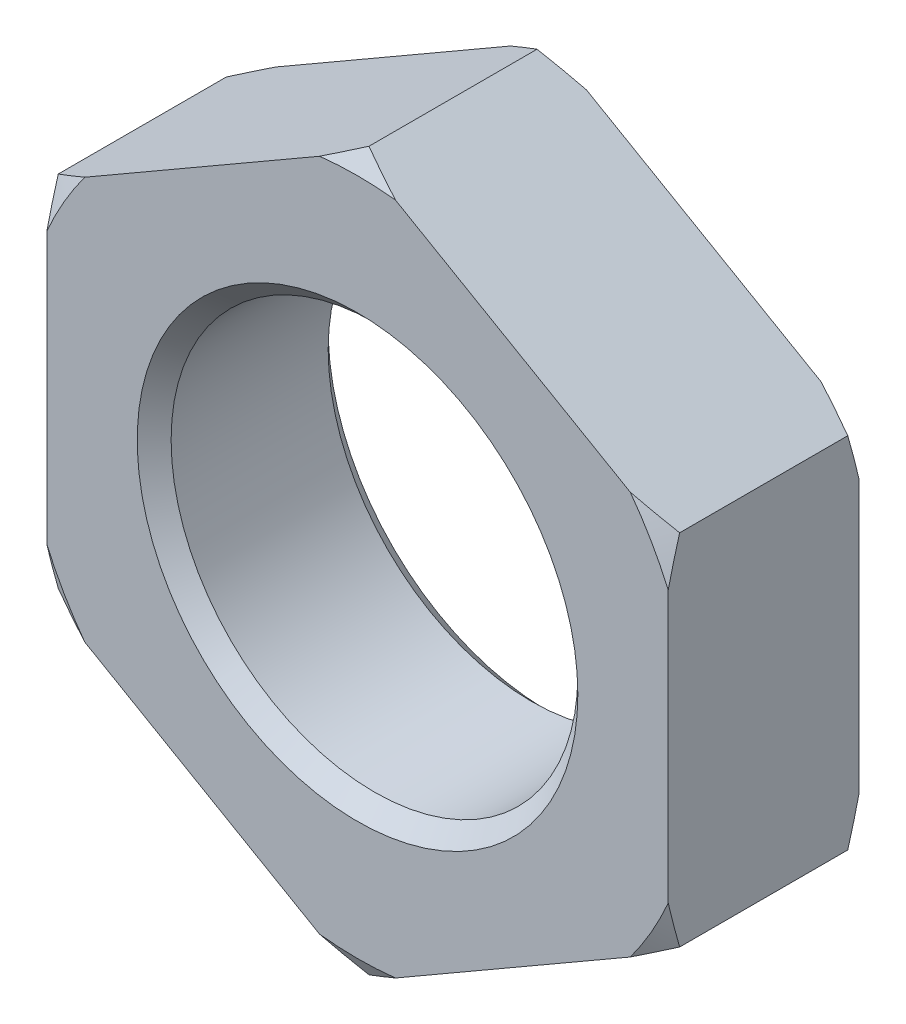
ISO-10303-21;
HEADER;
FILE_DESCRIPTION(('STEP AP214'),'2;1');
FILE_NAME('part.step','',(''),(''),'','','');
FILE_SCHEMA(('AUTOMOTIVE_DESIGN { 1 0 10303 214 1 1 1 1 }'));
ENDSEC;
DATA;
#1=APPLICATION_CONTEXT('core data for automotive mechanical design processes');
#2=APPLICATION_PROTOCOL_DEFINITION('international standard','automotive_design',2000,#1);
#3=PRODUCT_CONTEXT('',#1,'mechanical');
#4=PRODUCT('Part','Part','',(#3));
#5=PRODUCT_RELATED_PRODUCT_CATEGORY('part','',(#4));
#6=PRODUCT_DEFINITION_FORMATION('','',#4);
#7=PRODUCT_DEFINITION_CONTEXT('part definition',#1,'design');
#8=PRODUCT_DEFINITION('design','',#6,#7);
#9=PRODUCT_DEFINITION_SHAPE('','',#8);
#10=(LENGTH_UNIT() NAMED_UNIT(*) SI_UNIT(.MILLI.,.METRE.));
#11=(NAMED_UNIT(*) PLANE_ANGLE_UNIT() SI_UNIT($,.RADIAN.));
#12=(NAMED_UNIT(*) SI_UNIT($,.STERADIAN.) SOLID_ANGLE_UNIT());
#13=UNCERTAINTY_MEASURE_WITH_UNIT(LENGTH_MEASURE(1.E-05),#10,'distance_accuracy_value','');
#14=(GEOMETRIC_REPRESENTATION_CONTEXT(3) GLOBAL_UNCERTAINTY_ASSIGNED_CONTEXT((#13)) GLOBAL_UNIT_ASSIGNED_CONTEXT((#10,
#11,#12)) REPRESENTATION_CONTEXT('',''));
#15=CARTESIAN_POINT('',(0.,0.,0.));
#16=DIRECTION('',(0.,0.,1.));
#17=DIRECTION('',(1.,0.,0.));
#18=AXIS2_PLACEMENT_3D('',#15,#16,#17);
#19=CARTESIAN_POINT('',(0.,0.,-8.45));
#20=DIRECTION('',(0.,0.,1.));
#21=DIRECTION('',(1.,0.,0.));
#22=AXIS2_PLACEMENT_3D('',#19,#20,#21);
#23=PLANE('',#22);
#24=CARTESIAN_POINT('',(0.,0.,-8.45));
#25=DIRECTION('',(0.,0.,1.));
#26=DIRECTION('',(1.,0.,0.));
#27=AXIS2_PLACEMENT_3D('',#24,#25,#26);
#28=CIRCLE('',#27,19.5);
#29=CARTESIAN_POINT('',(19.5,0.,-8.45));
#30=VERTEX_POINT('',#29);
#31=EDGE_CURVE('E428',#30,#30,#28,.T.);
#32=ORIENTED_EDGE('',*,*,#31,.T.);
#33=EDGE_LOOP('',(#32));
#34=FACE_BOUND('',#33,.T.);
#35=DIRECTION('',(0.,1.,0.));
#36=VECTOR('',#35,1.);
#37=CARTESIAN_POINT('',(27.5,-15.8771324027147,-8.45));
#38=LINE('',#37,#36);
#39=CARTESIAN_POINT('',(27.5,-12.0002461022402,-8.45));
#40=VERTEX_POINT('',#39);
#41=CARTESIAN_POINT('',(27.5,12.0002461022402,-8.45));
#42=VERTEX_POINT('',#41);
#43=EDGE_CURVE('E363',#40,#42,#38,.T.);
#44=ORIENTED_EDGE('',*,*,#43,.F.);
#45=CARTESIAN_POINT('',(0.,0.,-8.45));
#46=DIRECTION('',(0.,0.,-1.));
#47=DIRECTION('',(-1.,0.,0.));
#48=AXIS2_PLACEMENT_3D('',#45,#46,#47);
#49=CIRCLE('',#48,30.0042648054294);
#50=CARTESIAN_POINT('',(24.1425179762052,-17.815575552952,-8.45));
#51=VERTEX_POINT('',#50);
#52=EDGE_CURVE('E351',#40,#51,#49,.T.);
#53=ORIENTED_EDGE('',*,*,#52,.T.);
#54=DIRECTION('',(0.866025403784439,0.5,0.));
#55=VECTOR('',#54,1.);
#56=CARTESIAN_POINT('',(0.,-31.7542648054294,-8.45));
#57=LINE('',#56,#55);
#58=CARTESIAN_POINT('',(3.3574820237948,-29.8158216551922,-8.45));
#59=VERTEX_POINT('',#58);
#60=EDGE_CURVE('E374',#59,#51,#57,.T.);
#61=ORIENTED_EDGE('',*,*,#60,.F.);
#62=CARTESIAN_POINT('',(-3.3574820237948,-29.8158216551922,-8.45));
#63=VERTEX_POINT('',#62);
#64=EDGE_CURVE('E346',#59,#63,#49,.T.);
#65=ORIENTED_EDGE('',*,*,#64,.T.);
#66=DIRECTION('',(0.866025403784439,-0.5,0.));
#67=VECTOR('',#66,1.);
#68=CARTESIAN_POINT('',(-27.5,-15.8771324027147,-8.45));
#69=LINE('',#68,#67);
#70=CARTESIAN_POINT('',(-24.1425179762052,-17.815575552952,-8.45));
#71=VERTEX_POINT('',#70);
#72=EDGE_CURVE('E379',#71,#63,#69,.T.);
#73=ORIENTED_EDGE('',*,*,#72,.F.);
#74=CARTESIAN_POINT('',(-27.5,-12.0002461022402,-8.45));
#75=VERTEX_POINT('',#74);
#76=EDGE_CURVE('E339',#71,#75,#49,.T.);
#77=ORIENTED_EDGE('',*,*,#76,.T.);
#78=DIRECTION('',(0.,-1.,0.));
#79=VECTOR('',#78,1.);
#80=CARTESIAN_POINT('',(-27.5,15.8771324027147,-8.45));
#81=LINE('',#80,#79);
#82=CARTESIAN_POINT('',(-27.5,12.0002461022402,-8.45));
#83=VERTEX_POINT('',#82);
#84=EDGE_CURVE('E475',#83,#75,#81,.T.);
#85=ORIENTED_EDGE('',*,*,#84,.F.);
#86=CARTESIAN_POINT('',(-24.1425179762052,17.815575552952,-8.45));
#87=VERTEX_POINT('',#86);
#88=EDGE_CURVE('E63',#83,#87,#49,.T.);
#89=ORIENTED_EDGE('',*,*,#88,.T.);
#90=DIRECTION('',(-0.866025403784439,-0.5,0.));
#91=VECTOR('',#90,1.);
#92=CARTESIAN_POINT('',(0.,31.7542648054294,-8.45));
#93=LINE('',#92,#91);
#94=CARTESIAN_POINT('',(-3.35748202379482,29.8158216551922,-8.45));
#95=VERTEX_POINT('',#94);
#96=EDGE_CURVE('E181',#95,#87,#93,.T.);
#97=ORIENTED_EDGE('',*,*,#96,.F.);
#98=CARTESIAN_POINT('',(3.35748202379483,29.8158216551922,-8.45));
#99=VERTEX_POINT('',#98);
#100=EDGE_CURVE('E55',#95,#99,#49,.T.);
#101=ORIENTED_EDGE('',*,*,#100,.T.);
#102=DIRECTION('',(-0.866025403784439,0.5,0.));
#103=VECTOR('',#102,1.);
#104=CARTESIAN_POINT('',(27.5,15.8771324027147,-8.45));
#105=LINE('',#104,#103);
#106=CARTESIAN_POINT('',(24.1425179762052,17.815575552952,-8.45));
#107=VERTEX_POINT('',#106);
#108=EDGE_CURVE('E364',#107,#99,#105,.T.);
#109=ORIENTED_EDGE('',*,*,#108,.F.);
#110=EDGE_CURVE('E343',#107,#42,#49,.T.);
#111=ORIENTED_EDGE('',*,*,#110,.T.);
#112=EDGE_LOOP('',(#44,#53,#61,#65,#73,#77,#85,#89,#97,#101,#109,#111));
#113=FACE_BOUND('',#112,.T.);
#114=ADVANCED_FACE('F39',(#34,#113),#23,.F.);
#115=CARTESIAN_POINT('',(0.,0.,8.45));
#116=DIRECTION('',(0.,0.,1.));
#117=DIRECTION('',(1.,0.,0.));
#118=AXIS2_PLACEMENT_3D('',#115,#116,#117);
#119=PLANE('',#118);
#120=CARTESIAN_POINT('',(0.,0.,8.45));
#121=DIRECTION('',(0.,0.,1.));
#122=DIRECTION('',(1.,0.,0.));
#123=AXIS2_PLACEMENT_3D('',#120,#121,#122);
#124=CIRCLE('',#123,19.5);
#125=CARTESIAN_POINT('',(19.5,0.,8.45));
#126=VERTEX_POINT('',#125);
#127=EDGE_CURVE('E11',#126,#126,#124,.F.);
#128=ORIENTED_EDGE('',*,*,#127,.T.);
#129=EDGE_LOOP('',(#128));
#130=FACE_BOUND('',#129,.T.);
#131=CARTESIAN_POINT('',(0.,0.,8.45));
#132=DIRECTION('',(0.,0.,-1.));
#133=DIRECTION('',(-1.,0.,0.));
#134=AXIS2_PLACEMENT_3D('',#131,#132,#133);
#135=CIRCLE('',#134,30.0042648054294);
#136=CARTESIAN_POINT('',(27.5,-12.0002461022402,8.45));
#137=VERTEX_POINT('',#136);
#138=CARTESIAN_POINT('',(24.1425179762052,-17.815575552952,8.45));
#139=VERTEX_POINT('',#138);
#140=EDGE_CURVE('E315',#137,#139,#135,.T.);
#141=ORIENTED_EDGE('',*,*,#140,.F.);
#142=DIRECTION('',(0.,1.,0.));
#143=VECTOR('',#142,1.);
#144=CARTESIAN_POINT('',(27.5,-15.8771324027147,8.45));
#145=LINE('',#144,#143);
#146=CARTESIAN_POINT('',(27.5,12.0002461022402,8.45));
#147=VERTEX_POINT('',#146);
#148=EDGE_CURVE('E386',#137,#147,#145,.T.);
#149=ORIENTED_EDGE('',*,*,#148,.T.);
#150=CARTESIAN_POINT('',(24.1425179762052,17.815575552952,8.45));
#151=VERTEX_POINT('',#150);
#152=EDGE_CURVE('E306',#151,#147,#135,.T.);
#153=ORIENTED_EDGE('',*,*,#152,.F.);
#154=DIRECTION('',(-0.866025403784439,0.5,0.));
#155=VECTOR('',#154,1.);
#156=CARTESIAN_POINT('',(27.5,15.8771324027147,8.45));
#157=LINE('',#156,#155);
#158=CARTESIAN_POINT('',(3.35748202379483,29.8158216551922,8.45));
#159=VERTEX_POINT('',#158);
#160=EDGE_CURVE('E373',#151,#159,#157,.T.);
#161=ORIENTED_EDGE('',*,*,#160,.T.);
#162=CARTESIAN_POINT('',(-3.35748202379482,29.8158216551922,8.45));
#163=VERTEX_POINT('',#162);
#164=EDGE_CURVE('E297',#163,#159,#135,.T.);
#165=ORIENTED_EDGE('',*,*,#164,.F.);
#166=DIRECTION('',(-0.866025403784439,-0.5,0.));
#167=VECTOR('',#166,1.);
#168=CARTESIAN_POINT('',(0.,31.7542648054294,8.45));
#169=LINE('',#168,#167);
#170=CARTESIAN_POINT('',(-24.1425179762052,17.815575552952,8.45));
#171=VERTEX_POINT('',#170);
#172=EDGE_CURVE('E377',#163,#171,#169,.T.);
#173=ORIENTED_EDGE('',*,*,#172,.T.);
#174=CARTESIAN_POINT('',(-27.5,12.0002461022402,8.45));
#175=VERTEX_POINT('',#174);
#176=EDGE_CURVE('E295',#175,#171,#135,.T.);
#177=ORIENTED_EDGE('',*,*,#176,.F.);
#178=DIRECTION('',(0.,-1.,0.));
#179=VECTOR('',#178,1.);
#180=CARTESIAN_POINT('',(-27.5,15.8771324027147,8.45));
#181=LINE('',#180,#179);
#182=CARTESIAN_POINT('',(-27.5,-12.0002461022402,8.45));
#183=VERTEX_POINT('',#182);
#184=EDGE_CURVE('E480',#175,#183,#181,.T.);
#185=ORIENTED_EDGE('',*,*,#184,.T.);
#186=CARTESIAN_POINT('',(-24.1425179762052,-17.815575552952,8.45));
#187=VERTEX_POINT('',#186);
#188=EDGE_CURVE('E298',#187,#183,#135,.T.);
#189=ORIENTED_EDGE('',*,*,#188,.F.);
#190=DIRECTION('',(0.866025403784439,-0.5,0.));
#191=VECTOR('',#190,1.);
#192=CARTESIAN_POINT('',(-27.5,-15.8771324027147,8.45));
#193=LINE('',#192,#191);
#194=CARTESIAN_POINT('',(-3.3574820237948,-29.8158216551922,8.45));
#195=VERTEX_POINT('',#194);
#196=EDGE_CURVE('E467',#187,#195,#193,.T.);
#197=ORIENTED_EDGE('',*,*,#196,.T.);
#198=CARTESIAN_POINT('',(3.35748202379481,-29.8158216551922,8.45));
#199=VERTEX_POINT('',#198);
#200=EDGE_CURVE('E308',#199,#195,#135,.T.);
#201=ORIENTED_EDGE('',*,*,#200,.F.);
#202=DIRECTION('',(0.866025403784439,0.5,0.));
#203=VECTOR('',#202,1.);
#204=CARTESIAN_POINT('',(0.,-31.7542648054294,8.45));
#205=LINE('',#204,#203);
#206=EDGE_CURVE('E465',#199,#139,#205,.T.);
#207=ORIENTED_EDGE('',*,*,#206,.T.);
#208=EDGE_LOOP('',(#141,#149,#153,#161,#165,#173,#177,#185,#189,#197,#201,#207));
#209=FACE_BOUND('',#208,.T.);
#210=ADVANCED_FACE('F419',(#130,#209),#119,.T.);
#211=CARTESIAN_POINT('',(27.5,15.8771324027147,8.45));
#212=DIRECTION('',(-0.5,-0.866025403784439,0.));
#213=DIRECTION('',(0.866025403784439,-0.5,0.));
#214=AXIS2_PLACEMENT_3D('',#211,#212,#213);
#215=PLANE('',#214);
#216=DIRECTION('',(0.,0.,-1.));
#217=VECTOR('',#216,1.);
#218=CARTESIAN_POINT('',(27.5,15.8771324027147,8.45));
#219=LINE('',#218,#217);
#220=CARTESIAN_POINT('',(27.5,15.8771324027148,7.43963702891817));
#221=VERTEX_POINT('',#220);
#222=CARTESIAN_POINT('',(27.5,15.8771324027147,-7.43963702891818));
#223=VERTEX_POINT('',#222);
#224=EDGE_CURVE('E383',#221,#223,#219,.T.);
#225=ORIENTED_EDGE('',*,*,#224,.T.);
#226=CARTESIAN_POINT('',(46.5624008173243,4.871450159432,1.25657024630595));
#227=CARTESIAN_POINT('',(46.130495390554,5.1208108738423,1.0235474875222));
#228=CARTESIAN_POINT('',(45.6980657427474,5.370474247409,0.791821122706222));
#229=CARTESIAN_POINT('',(44.8320661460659,5.8704593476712,0.331215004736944));
#230=CARTESIAN_POINT('',(44.3984961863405,6.12078108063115,0.102335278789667));
#231=CARTESIAN_POINT('',(43.0958488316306,6.87286488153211,-0.579699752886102));
#232=CARTESIAN_POINT('',(42.2249349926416,7.37568722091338,-1.02819626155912));
#233=CARTESIAN_POINT('',(40.4746221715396,8.38623079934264,-1.91165839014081));
#234=CARTESIAN_POINT('',(39.5952048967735,8.89396259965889,-2.3465757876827));
#235=CARTESIAN_POINT('',(37.829772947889,9.91323521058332,-3.19814073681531));
#236=CARTESIAN_POINT('',(36.9437584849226,10.4247758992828,-3.61478887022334));
#237=CARTESIAN_POINT('',(35.1415605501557,11.4652753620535,-4.43606710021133));
#238=CARTESIAN_POINT('',(34.2251810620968,11.9943473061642,-4.8401261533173));
#239=CARTESIAN_POINT('',(32.3831614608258,13.0578378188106,-5.61938829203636));
#240=CARTESIAN_POINT('',(31.4575208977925,13.5922566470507,-5.99458996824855));
#241=CARTESIAN_POINT('',(29.5968126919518,14.6665370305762,-6.70897239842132));
#242=CARTESIAN_POINT('',(28.6617551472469,15.2063927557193,-7.04818800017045));
#243=CARTESIAN_POINT('',(26.7805346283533,16.2925159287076,-7.68277052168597));
#244=CARTESIAN_POINT('',(25.8343731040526,16.8387825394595,-7.97814309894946));
#245=CARTESIAN_POINT('',(24.2270196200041,17.7667885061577,-8.4319078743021));
#246=CARTESIAN_POINT('',(23.5687959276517,18.1468141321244,-8.60431989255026));
#247=CARTESIAN_POINT('',(22.2471886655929,18.909844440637,-8.92054702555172));
#248=CARTESIAN_POINT('',(21.5838052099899,19.2928490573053,-9.06436277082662));
#249=CARTESIAN_POINT('',(20.2525937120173,20.0614243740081,-9.32013894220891));
#250=CARTESIAN_POINT('',(19.5847668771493,20.4469943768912,-9.43210768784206));
#251=CARTESIAN_POINT('',(18.2454090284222,21.220272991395,-9.62135504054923));
#252=CARTESIAN_POINT('',(17.5738780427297,21.6079815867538,-9.69863391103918));
#253=CARTESIAN_POINT('',(16.2361631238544,22.3803116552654,-9.81561030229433));
#254=CARTESIAN_POINT('',(15.5700072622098,22.7649169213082,-9.85573244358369));
#255=CARTESIAN_POINT('',(14.2367949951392,23.5346473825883,-9.89872558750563));
#256=CARTESIAN_POINT('',(13.5697386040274,23.9197725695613,-9.90159717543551));
#257=CARTESIAN_POINT('',(12.2362630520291,24.6896550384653,-9.87000288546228));
#258=CARTESIAN_POINT('',(11.569843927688,25.0744122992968,-9.83553498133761));
#259=CARTESIAN_POINT('',(10.2391365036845,25.8426965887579,-9.7302889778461));
#260=CARTESIAN_POINT('',(9.5748482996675,26.2262235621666,-9.659509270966));
#261=CARTESIAN_POINT('',(8.45830301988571,26.870861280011,-9.51134038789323));
#262=CARTESIAN_POINT('',(8.00512003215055,27.1325065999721,-9.44304388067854));
#263=CARTESIAN_POINT('',(7.10066752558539,27.6546924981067,-9.29120176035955));
#264=CARTESIAN_POINT('',(6.6493980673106,27.9152330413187,-9.20765566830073));
#265=CARTESIAN_POINT('',(5.29875750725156,28.6950257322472,-8.93551737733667));
#266=CARTESIAN_POINT('',(4.40259488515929,29.2124254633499,-8.72543071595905));
#267=CARTESIAN_POINT('',(2.6192377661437,30.2420471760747,-8.25588238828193));
#268=CARTESIAN_POINT('',(1.73205332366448,30.754263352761,-7.99637069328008));
#269=CARTESIAN_POINT('',(-0.0323939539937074,31.7729674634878,-7.43612177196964));
#270=CARTESIAN_POINT('',(-0.909657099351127,32.2794555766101,-7.13538583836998));
#271=CARTESIAN_POINT('',(-2.66490555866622,33.2928487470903,-6.49615791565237));
#272=CARTESIAN_POINT('',(-3.54278168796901,33.7996907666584,-6.15726918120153));
#273=CARTESIAN_POINT('',(-5.28982226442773,34.8083451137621,-5.45089711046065));
#274=CARTESIAN_POINT('',(-6.15898663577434,35.3101573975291,-5.08341352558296));
#275=CARTESIAN_POINT('',(-7.88912278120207,36.3090519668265,-4.32520989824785));
#276=CARTESIAN_POINT('',(-8.75009862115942,36.8061365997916,-3.93450217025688));
#277=CARTESIAN_POINT('',(-10.4652728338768,37.7963928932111,-3.13384904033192));
#278=CARTESIAN_POINT('',(-11.3194713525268,38.2895646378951,-2.72390405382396));
#279=CARTESIAN_POINT('',(-12.7528673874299,39.1171362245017,-2.02021947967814));
#280=CARTESIAN_POINT('',(-13.3336308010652,39.4524401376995,-1.73071472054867));
#281=CARTESIAN_POINT('',(-14.4926499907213,40.1216001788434,-1.1451469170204));
#282=CARTESIAN_POINT('',(-15.0709058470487,40.4554563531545,-0.849084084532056));
#283=CARTESIAN_POINT('',(-16.2191637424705,41.1184033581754,-0.254272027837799));
#284=CARTESIAN_POINT('',(-16.7891890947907,41.4475076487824,0.0444172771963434));
#285=CARTESIAN_POINT('',(-17.9272439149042,42.1045639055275,0.646855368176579));
#286=CARTESIAN_POINT('',(-18.4952733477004,42.43251585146,0.950604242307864));
#287=CARTESIAN_POINT('',(-19.0624008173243,42.7599470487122,1.25657024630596));
#288=B_SPLINE_CURVE_WITH_KNOTS('',3,(#226,#227,#228,#229,#230,#231,#232,#233,#234,#235,#236,
#237,#238,#239,#240,#241,#242,#243,#244,#245,#246,#247,#248,#249,#250,#251,#252,#253,#254,#255,
#256,#257,#258,#259,#260,#261,#262,#263,#264,#265,#266,#267,#268,#269,#270,#271,#272,#273,#274,
#275,#276,#277,#278,#279,#280,#281,#282,#283,#284,#285,#286,#287),.UNSPECIFIED.,.F.,.F.,(4,2,2,
2,2,2,2,2,2,2,2,2,2,2,2,2,2,2,2,2,2,2,2,2,2,2,2,2,2,2,4),(0.,1.6514213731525,3.30285851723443,
6.60611926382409,9.92001705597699,13.2338092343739,16.6314698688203,20.029296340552,
23.423801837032,26.817868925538,29.1554860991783,31.4930517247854,33.8300061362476,
36.1669428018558,38.4768313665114,40.7866836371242,43.0966612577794,45.4067411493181,
46.989706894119,48.5727223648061,51.7388949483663,54.9082895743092,58.0775848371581,
61.283565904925,64.4895748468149,67.6938987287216,70.8981534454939,73.0894093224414,
75.2805944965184,77.4490016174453,79.6174465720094),.UNSPECIFIED.);
#289=EDGE_CURVE('E319',#223,#107,#288,.T.);
#290=ORIENTED_EDGE('',*,*,#289,.T.);
#291=ORIENTED_EDGE('',*,*,#108,.T.);
#292=CARTESIAN_POINT('',(0.,31.7542648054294,-7.43963702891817));
#293=VERTEX_POINT('',#292);
#294=EDGE_CURVE('E309',#99,#293,#288,.T.);
#295=ORIENTED_EDGE('',*,*,#294,.T.);
#296=DIRECTION('',(0.,0.,-1.));
#297=VECTOR('',#296,1.);
#298=CARTESIAN_POINT('',(0.,31.7542648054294,8.45));
#299=LINE('',#298,#297);
#300=CARTESIAN_POINT('',(0.,31.7542648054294,7.43963702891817));
#301=VERTEX_POINT('',#300);
#302=EDGE_CURVE('E190',#301,#293,#299,.T.);
#303=ORIENTED_EDGE('',*,*,#302,.F.);
#304=CARTESIAN_POINT('',(-19.0624008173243,42.7599470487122,-1.25657024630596));
#305=CARTESIAN_POINT('',(-18.630495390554,42.5105863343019,-1.02354748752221));
#306=CARTESIAN_POINT('',(-18.1980657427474,42.2609229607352,-0.79182112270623));
#307=CARTESIAN_POINT('',(-17.3320661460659,41.760937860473,-0.331215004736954));
#308=CARTESIAN_POINT('',(-16.8984961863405,41.510616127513,-0.10233527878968));
#309=CARTESIAN_POINT('',(-15.5958488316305,40.7585323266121,0.579699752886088));
#310=CARTESIAN_POINT('',(-14.7249349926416,40.2557099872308,1.02819626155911));
#311=CARTESIAN_POINT('',(-12.9746221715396,39.2451664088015,1.91165839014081));
#312=CARTESIAN_POINT('',(-12.0952048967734,38.7374346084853,2.34657578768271));
#313=CARTESIAN_POINT('',(-10.3297729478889,37.7181619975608,3.19814073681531));
#314=CARTESIAN_POINT('',(-9.4437584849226,37.2066213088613,3.61478887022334));
#315=CARTESIAN_POINT('',(-7.64156055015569,36.1661218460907,4.43606710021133));
#316=CARTESIAN_POINT('',(-6.72518106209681,35.63704990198,4.8401261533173));
#317=CARTESIAN_POINT('',(-4.88316146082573,34.5735593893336,5.61938829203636));
#318=CARTESIAN_POINT('',(-3.95752089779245,34.0391405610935,5.99458996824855));
#319=CARTESIAN_POINT('',(-2.09681269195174,32.964860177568,6.70897239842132));
#320=CARTESIAN_POINT('',(-1.16175514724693,32.4250044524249,7.04818800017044));
#321=CARTESIAN_POINT('',(0.719465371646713,31.3388812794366,7.68277052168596));
#322=CARTESIAN_POINT('',(1.66562689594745,30.7926146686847,7.97814309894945));
#323=CARTESIAN_POINT('',(3.2729803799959,29.8646087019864,8.4319078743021));
#324=CARTESIAN_POINT('',(3.93120407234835,29.4845830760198,8.60431989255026));
#325=CARTESIAN_POINT('',(5.25281133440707,28.7215527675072,8.92054702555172));
#326=CARTESIAN_POINT('',(5.91619479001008,28.3385481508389,9.06436277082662));
#327=CARTESIAN_POINT('',(7.24740628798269,27.569972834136,9.3201389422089));
#328=CARTESIAN_POINT('',(7.91523312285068,27.184402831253,9.43210768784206));
#329=CARTESIAN_POINT('',(9.25459097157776,26.4111242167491,9.62135504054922));
#330=CARTESIAN_POINT('',(9.92612195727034,26.0234156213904,9.69863391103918));
#331=CARTESIAN_POINT('',(11.2638368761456,25.2510855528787,9.81561030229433));
#332=CARTESIAN_POINT('',(11.9299927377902,24.866480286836,9.85573244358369));
#333=CARTESIAN_POINT('',(13.2632050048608,24.0967498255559,9.89872558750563));
#334=CARTESIAN_POINT('',(13.9302613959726,23.7116246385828,9.90159717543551));
#335=CARTESIAN_POINT('',(15.2637369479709,22.9417421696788,9.87000288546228));
#336=CARTESIAN_POINT('',(15.930156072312,22.5569849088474,9.83553498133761));
#337=CARTESIAN_POINT('',(17.2608634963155,21.7887006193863,9.7302889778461));
#338=CARTESIAN_POINT('',(17.9251517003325,21.4051736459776,9.659509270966));
#339=CARTESIAN_POINT('',(19.0416969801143,20.7605359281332,9.51134038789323));
#340=CARTESIAN_POINT('',(19.4948799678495,20.4988906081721,9.44304388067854));
#341=CARTESIAN_POINT('',(20.3993324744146,19.9767047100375,9.29120176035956));
#342=CARTESIAN_POINT('',(20.8506019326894,19.7161641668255,9.20765566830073));
#343=CARTESIAN_POINT('',(22.2012424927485,18.936371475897,8.93551737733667));
#344=CARTESIAN_POINT('',(23.0974051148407,18.4189717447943,8.72543071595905));
#345=CARTESIAN_POINT('',(24.8807622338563,17.3893500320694,8.25588238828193));
#346=CARTESIAN_POINT('',(25.7679466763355,16.8771338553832,7.99637069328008));
#347=CARTESIAN_POINT('',(27.5323939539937,15.8584297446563,7.43612177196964));
#348=CARTESIAN_POINT('',(28.4096570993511,15.3519416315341,7.13538583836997));
#349=CARTESIAN_POINT('',(30.1649055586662,14.3385484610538,6.49615791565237));
#350=CARTESIAN_POINT('',(31.042781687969,13.8317064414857,6.15726918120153));
#351=CARTESIAN_POINT('',(32.7898222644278,12.8230520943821,5.45089711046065));
#352=CARTESIAN_POINT('',(33.6589866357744,12.3212398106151,5.08341352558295));
#353=CARTESIAN_POINT('',(35.3891227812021,11.3223452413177,4.32520989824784));
#354=CARTESIAN_POINT('',(36.2500986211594,10.8252606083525,3.93450217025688));
#355=CARTESIAN_POINT('',(37.9652728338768,9.83500431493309,3.13384904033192));
#356=CARTESIAN_POINT('',(38.8194713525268,9.3418325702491,2.72390405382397));
#357=CARTESIAN_POINT('',(40.2528673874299,8.51426098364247,2.02021947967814));
#358=CARTESIAN_POINT('',(40.8336308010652,8.17895707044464,1.73071472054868));
#359=CARTESIAN_POINT('',(41.9926499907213,7.50979702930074,1.1451469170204));
#360=CARTESIAN_POINT('',(42.5709058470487,7.17594085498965,0.84908408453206));
#361=CARTESIAN_POINT('',(43.7191637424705,6.51299384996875,0.254272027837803));
#362=CARTESIAN_POINT('',(44.2891890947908,6.18388955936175,-0.0444172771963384));
#363=CARTESIAN_POINT('',(45.4272439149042,5.5268333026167,-0.646855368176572));
#364=CARTESIAN_POINT('',(45.9952733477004,5.1988813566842,-0.950604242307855));
#365=CARTESIAN_POINT('',(46.5624008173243,4.871450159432,-1.25657024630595));
#366=B_SPLINE_CURVE_WITH_KNOTS('',3,(#304,#305,#306,#307,#308,#309,#310,#311,#312,#313,#314,
#315,#316,#317,#318,#319,#320,#321,#322,#323,#324,#325,#326,#327,#328,#329,#330,#331,#332,#333,
#334,#335,#336,#337,#338,#339,#340,#341,#342,#343,#344,#345,#346,#347,#348,#349,#350,#351,#352,
#353,#354,#355,#356,#357,#358,#359,#360,#361,#362,#363,#364,#365),.UNSPECIFIED.,.F.,.F.,(4,2,2,
2,2,2,2,2,2,2,2,2,2,2,2,2,2,2,2,2,2,2,2,2,2,2,2,2,2,2,4),(0.,1.6514213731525,3.30285851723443,
6.6061192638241,9.92001705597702,13.233809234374,16.6314698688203,20.029296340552,
23.423801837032,26.8178689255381,29.1554860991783,31.4930517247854,33.8300061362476,
36.1669428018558,38.4768313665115,40.7866836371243,43.0966612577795,45.4067411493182,
46.989706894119,48.5727223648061,51.7388949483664,54.9082895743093,58.0775848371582,
61.283565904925,64.4895748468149,67.6938987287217,70.898153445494,73.0894093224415,
75.2805944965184,77.4490016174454,79.6174465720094),.UNSPECIFIED.);
#367=EDGE_CURVE('E473',#301,#159,#366,.T.);
#368=ORIENTED_EDGE('',*,*,#367,.T.);
#369=ORIENTED_EDGE('',*,*,#160,.F.);
#370=EDGE_CURVE('E248',#151,#221,#366,.T.);
#371=ORIENTED_EDGE('',*,*,#370,.T.);
#372=EDGE_LOOP('',(#225,#290,#291,#295,#303,#368,#369,#371));
#373=FACE_BOUND('',#372,.T.);
#374=ADVANCED_FACE('F424',(#373),#215,.F.);
#375=CARTESIAN_POINT('',(0.,31.7542648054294,8.45));
#376=DIRECTION('',(0.5,-0.866025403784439,0.));
#377=DIRECTION('',(0.866025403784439,0.5,0.));
#378=AXIS2_PLACEMENT_3D('',#375,#376,#377);
#379=PLANE('',#378);
#380=ORIENTED_EDGE('',*,*,#302,.T.);
#381=CARTESIAN_POINT('',(19.0624008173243,42.7599470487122,1.25657024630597));
#382=CARTESIAN_POINT('',(18.630495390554,42.5105863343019,1.02354748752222));
#383=CARTESIAN_POINT('',(18.1980657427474,42.2609229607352,0.79182112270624));
#384=CARTESIAN_POINT('',(17.3320661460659,41.760937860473,0.331215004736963));
#385=CARTESIAN_POINT('',(16.8984961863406,41.510616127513,0.102335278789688));
#386=CARTESIAN_POINT('',(15.5958488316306,40.758532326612,-0.57969975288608));
#387=CARTESIAN_POINT('',(14.7249349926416,40.2557099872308,-1.0281962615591));
#388=CARTESIAN_POINT('',(12.9746221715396,39.2451664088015,-1.91165839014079));
#389=CARTESIAN_POINT('',(12.0952048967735,38.7374346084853,-2.34657578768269));
#390=CARTESIAN_POINT('',(10.329772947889,37.7181619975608,-3.19814073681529));
#391=CARTESIAN_POINT('',(9.44375848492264,37.2066213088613,-3.61478887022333));
#392=CARTESIAN_POINT('',(7.64156055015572,36.1661218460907,-4.43606710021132));
#393=CARTESIAN_POINT('',(6.72518106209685,35.63704990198,-4.84012615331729));
#394=CARTESIAN_POINT('',(4.88316146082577,34.5735593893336,-5.61938829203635));
#395=CARTESIAN_POINT('',(3.95752089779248,34.0391405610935,-5.99458996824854));
#396=CARTESIAN_POINT('',(2.09681269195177,32.964860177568,-6.70897239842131));
#397=CARTESIAN_POINT('',(1.16175514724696,32.4250044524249,-7.04818800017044));
#398=CARTESIAN_POINT('',(-0.719465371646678,31.3388812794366,-7.68277052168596));
#399=CARTESIAN_POINT('',(-1.66562689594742,30.7926146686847,-7.97814309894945));
#400=CARTESIAN_POINT('',(-3.27298037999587,29.8646087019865,-8.43190787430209));
#401=CARTESIAN_POINT('',(-3.93120407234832,29.4845830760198,-8.60431989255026));
#402=CARTESIAN_POINT('',(-5.25281133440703,28.7215527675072,-8.92054702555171));
#403=CARTESIAN_POINT('',(-5.91619479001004,28.3385481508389,-9.06436277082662));
#404=CARTESIAN_POINT('',(-7.24740628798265,27.5699728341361,-9.3201389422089));
#405=CARTESIAN_POINT('',(-7.91523312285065,27.184402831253,-9.43210768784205));
#406=CARTESIAN_POINT('',(-9.25459097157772,26.4111242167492,-9.62135504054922));
#407=CARTESIAN_POINT('',(-9.92612195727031,26.0234156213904,-9.69863391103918));
#408=CARTESIAN_POINT('',(-11.2638368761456,25.2510855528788,-9.81561030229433));
#409=CARTESIAN_POINT('',(-11.9299927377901,24.866480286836,-9.85573244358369));
#410=CARTESIAN_POINT('',(-13.2632050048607,24.0967498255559,-9.89872558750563));
#411=CARTESIAN_POINT('',(-13.9302613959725,23.7116246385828,-9.90159717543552));
#412=CARTESIAN_POINT('',(-15.2637369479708,22.9417421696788,-9.87000288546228));
#413=CARTESIAN_POINT('',(-15.9301560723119,22.5569849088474,-9.83553498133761));
#414=CARTESIAN_POINT('',(-17.2608634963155,21.7887006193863,-9.73028897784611));
#415=CARTESIAN_POINT('',(-17.9251517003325,21.4051736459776,-9.659509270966));
#416=CARTESIAN_POINT('',(-19.0416969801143,20.7605359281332,-9.51134038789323));
#417=CARTESIAN_POINT('',(-19.4948799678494,20.4988906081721,-9.44304388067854));
#418=CARTESIAN_POINT('',(-20.3993324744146,19.9767047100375,-9.29120176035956));
#419=CARTESIAN_POINT('',(-20.8506019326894,19.7161641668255,-9.20765566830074));
#420=CARTESIAN_POINT('',(-22.2012424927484,18.936371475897,-8.93551737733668));
#421=CARTESIAN_POINT('',(-23.0974051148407,18.4189717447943,-8.72543071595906));
#422=CARTESIAN_POINT('',(-24.8807622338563,17.3893500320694,-8.25588238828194));
#423=CARTESIAN_POINT('',(-25.7679466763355,16.8771338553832,-7.9963706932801));
#424=CARTESIAN_POINT('',(-27.5323939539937,15.8584297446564,-7.43612177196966));
#425=CARTESIAN_POINT('',(-28.4096570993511,15.3519416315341,-7.13538583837));
#426=CARTESIAN_POINT('',(-30.1649055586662,14.3385484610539,-6.49615791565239));
#427=CARTESIAN_POINT('',(-31.042781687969,13.8317064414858,-6.15726918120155));
#428=CARTESIAN_POINT('',(-32.7898222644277,12.8230520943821,-5.45089711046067));
#429=CARTESIAN_POINT('',(-33.6589866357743,12.3212398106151,-5.08341352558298));
#430=CARTESIAN_POINT('',(-35.389122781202,11.3223452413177,-4.32520989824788));
#431=CARTESIAN_POINT('',(-36.2500986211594,10.8252606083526,-3.93450217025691));
#432=CARTESIAN_POINT('',(-37.9652728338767,9.83500431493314,-3.13384904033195));
#433=CARTESIAN_POINT('',(-38.8194713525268,9.34183257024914,-2.723904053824));
#434=CARTESIAN_POINT('',(-40.2528673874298,8.51426098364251,-2.02021947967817));
#435=CARTESIAN_POINT('',(-40.8336308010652,8.17895707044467,-1.7307147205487));
#436=CARTESIAN_POINT('',(-41.9926499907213,7.50979702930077,-1.14514691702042));
#437=CARTESIAN_POINT('',(-42.5709058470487,7.17594085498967,-0.849084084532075));
#438=CARTESIAN_POINT('',(-43.7191637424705,6.51299384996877,-0.254272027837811));
#439=CARTESIAN_POINT('',(-44.2891890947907,6.18388955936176,0.0444172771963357));
#440=CARTESIAN_POINT('',(-45.4272439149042,5.5268333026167,0.646855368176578));
#441=CARTESIAN_POINT('',(-45.9952733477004,5.1988813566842,0.950604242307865));
#442=CARTESIAN_POINT('',(-46.5624008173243,4.87145015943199,1.25657024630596));
#443=B_SPLINE_CURVE_WITH_KNOTS('',3,(#381,#382,#383,#384,#385,#386,#387,#388,#389,#390,#391,
#392,#393,#394,#395,#396,#397,#398,#399,#400,#401,#402,#403,#404,#405,#406,#407,#408,#409,#410,
#411,#412,#413,#414,#415,#416,#417,#418,#419,#420,#421,#422,#423,#424,#425,#426,#427,#428,#429,
#430,#431,#432,#433,#434,#435,#436,#437,#438,#439,#440,#441,#442),.UNSPECIFIED.,.F.,.F.,(4,2,2,
2,2,2,2,2,2,2,2,2,2,2,2,2,2,2,2,2,2,2,2,2,2,2,2,2,2,2,4),(0.,1.6514213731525,3.30285851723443,
6.60611926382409,9.920017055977,13.2338092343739,16.6314698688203,20.029296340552,
23.423801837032,26.817868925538,29.1554860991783,31.4930517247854,33.8300061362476,
36.1669428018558,38.4768313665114,40.7866836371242,43.0966612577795,45.4067411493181,
46.989706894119,48.5727223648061,51.7388949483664,54.9082895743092,58.0775848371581,
61.283565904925,64.4895748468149,67.6938987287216,70.8981534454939,73.0894093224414,
75.2805944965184,77.4490016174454,79.6174465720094),.UNSPECIFIED.);
#444=EDGE_CURVE('E183',#293,#95,#443,.T.);
#445=ORIENTED_EDGE('',*,*,#444,.T.);
#446=ORIENTED_EDGE('',*,*,#96,.T.);
#447=CARTESIAN_POINT('',(-27.5,15.8771324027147,-7.43963702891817));
#448=VERTEX_POINT('',#447);
#449=EDGE_CURVE('E165',#87,#448,#443,.T.);
#450=ORIENTED_EDGE('',*,*,#449,.T.);
#451=DIRECTION('',(0.,0.,-1.));
#452=VECTOR('',#451,1.);
#453=CARTESIAN_POINT('',(-27.5,15.8771324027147,8.45));
#454=LINE('',#453,#452);
#455=CARTESIAN_POINT('',(-27.5,15.8771324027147,7.43963702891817));
#456=VERTEX_POINT('',#455);
#457=EDGE_CURVE('E179',#456,#448,#454,.T.);
#458=ORIENTED_EDGE('',*,*,#457,.F.);
#459=CARTESIAN_POINT('',(-46.5624008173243,4.87145015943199,-1.25657024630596));
#460=CARTESIAN_POINT('',(-46.130495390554,5.12081087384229,-1.02354748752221));
#461=CARTESIAN_POINT('',(-45.6980657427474,5.37047424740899,-0.791821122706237));
#462=CARTESIAN_POINT('',(-44.8320661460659,5.8704593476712,-0.33121500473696));
#463=CARTESIAN_POINT('',(-44.3984961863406,6.12078108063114,-0.102335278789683));
#464=CARTESIAN_POINT('',(-43.0958488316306,6.87286488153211,0.579699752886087));
#465=CARTESIAN_POINT('',(-42.2249349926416,7.37568722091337,1.0281962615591));
#466=CARTESIAN_POINT('',(-40.4746221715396,8.38623079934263,1.9116583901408));
#467=CARTESIAN_POINT('',(-39.5952048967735,8.89396259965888,2.3465757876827));
#468=CARTESIAN_POINT('',(-37.829772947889,9.91323521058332,3.1981407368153));
#469=CARTESIAN_POINT('',(-36.9437584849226,10.4247758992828,3.61478887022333));
#470=CARTESIAN_POINT('',(-35.1415605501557,11.4652753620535,4.43606710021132));
#471=CARTESIAN_POINT('',(-34.2251810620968,11.9943473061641,4.84012615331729));
#472=CARTESIAN_POINT('',(-32.3831614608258,13.0578378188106,5.61938829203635));
#473=CARTESIAN_POINT('',(-31.4575208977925,13.5922566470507,5.99458996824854));
#474=CARTESIAN_POINT('',(-29.5968126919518,14.6665370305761,6.70897239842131));
#475=CARTESIAN_POINT('',(-28.661755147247,15.2063927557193,7.04818800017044));
#476=CARTESIAN_POINT('',(-26.7805346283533,16.2925159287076,7.68277052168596));
#477=CARTESIAN_POINT('',(-25.8343731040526,16.8387825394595,7.97814309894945));
#478=CARTESIAN_POINT('',(-24.2270196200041,17.7667885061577,8.43190787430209));
#479=CARTESIAN_POINT('',(-23.5687959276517,18.1468141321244,8.60431989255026));
#480=CARTESIAN_POINT('',(-22.247188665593,18.9098444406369,8.92054702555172));
#481=CARTESIAN_POINT('',(-21.58380520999,19.2928490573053,9.06436277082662));
#482=CARTESIAN_POINT('',(-20.2525937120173,20.0614243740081,9.3201389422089));
#483=CARTESIAN_POINT('',(-19.5847668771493,20.4469943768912,9.43210768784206));
#484=CARTESIAN_POINT('',(-18.2454090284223,21.220272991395,9.62135504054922));
#485=CARTESIAN_POINT('',(-17.5738780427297,21.6079815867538,9.69863391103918));
#486=CARTESIAN_POINT('',(-16.2361631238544,22.3803116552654,9.81561030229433));
#487=CARTESIAN_POINT('',(-15.5700072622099,22.7649169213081,9.85573244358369));
#488=CARTESIAN_POINT('',(-14.2367949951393,23.5346473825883,9.89872558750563));
#489=CARTESIAN_POINT('',(-13.5697386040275,23.9197725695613,9.90159717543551));
#490=CARTESIAN_POINT('',(-12.2362630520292,24.6896550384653,9.87000288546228));
#491=CARTESIAN_POINT('',(-11.5698439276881,25.0744122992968,9.83553498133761));
#492=CARTESIAN_POINT('',(-10.2391365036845,25.8426965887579,9.73028897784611));
#493=CARTESIAN_POINT('',(-9.57484829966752,26.2262235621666,9.659509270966));
#494=CARTESIAN_POINT('',(-8.45830301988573,26.870861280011,9.51134038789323));
#495=CARTESIAN_POINT('',(-8.00512003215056,27.132506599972,9.44304388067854));
#496=CARTESIAN_POINT('',(-7.1006675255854,27.6546924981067,9.29120176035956));
#497=CARTESIAN_POINT('',(-6.64939806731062,27.9152330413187,9.20765566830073));
#498=CARTESIAN_POINT('',(-5.29875750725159,28.6950257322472,8.93551737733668));
#499=CARTESIAN_POINT('',(-4.40259488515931,29.2124254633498,8.72543071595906));
#500=CARTESIAN_POINT('',(-2.61923776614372,30.2420471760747,8.25588238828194));
#501=CARTESIAN_POINT('',(-1.7320533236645,30.7542633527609,7.99637069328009));
#502=CARTESIAN_POINT('',(0.0323939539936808,31.7729674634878,7.43612177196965));
#503=CARTESIAN_POINT('',(0.909657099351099,32.27945557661,7.13538583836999));
#504=CARTESIAN_POINT('',(2.6649055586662,33.2928487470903,6.49615791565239));
#505=CARTESIAN_POINT('',(3.54278168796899,33.7996907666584,6.15726918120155));
#506=CARTESIAN_POINT('',(5.28982226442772,34.808345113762,5.45089711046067));
#507=CARTESIAN_POINT('',(6.15898663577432,35.310157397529,5.08341352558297));
#508=CARTESIAN_POINT('',(7.88912278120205,36.3090519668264,4.32520989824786));
#509=CARTESIAN_POINT('',(8.7500986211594,36.8061365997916,3.9345021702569));
#510=CARTESIAN_POINT('',(10.4652728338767,37.796392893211,3.13384904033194));
#511=CARTESIAN_POINT('',(11.3194713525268,38.289564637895,2.72390405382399));
#512=CARTESIAN_POINT('',(12.7528673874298,39.1171362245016,2.02021947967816));
#513=CARTESIAN_POINT('',(13.3336308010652,39.4524401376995,1.73071472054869));
#514=CARTESIAN_POINT('',(14.4926499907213,40.1216001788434,1.14514691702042));
#515=CARTESIAN_POINT('',(15.0709058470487,40.4554563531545,0.849084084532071));
#516=CARTESIAN_POINT('',(16.2191637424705,41.1184033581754,0.254272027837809));
#517=CARTESIAN_POINT('',(16.7891890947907,41.4475076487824,-0.0444172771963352));
#518=CARTESIAN_POINT('',(17.9272439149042,42.1045639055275,-0.646855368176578));
#519=CARTESIAN_POINT('',(18.4952733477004,42.43251585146,-0.950604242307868));
#520=CARTESIAN_POINT('',(19.0624008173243,42.7599470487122,-1.25657024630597));
#521=B_SPLINE_CURVE_WITH_KNOTS('',3,(#459,#460,#461,#462,#463,#464,#465,#466,#467,#468,#469,
#470,#471,#472,#473,#474,#475,#476,#477,#478,#479,#480,#481,#482,#483,#484,#485,#486,#487,#488,
#489,#490,#491,#492,#493,#494,#495,#496,#497,#498,#499,#500,#501,#502,#503,#504,#505,#506,#507,
#508,#509,#510,#511,#512,#513,#514,#515,#516,#517,#518,#519,#520),.UNSPECIFIED.,.F.,.F.,(4,2,2,
2,2,2,2,2,2,2,2,2,2,2,2,2,2,2,2,2,2,2,2,2,2,2,2,2,2,2,4),(0.,1.6514213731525,3.30285851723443,
6.60611926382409,9.92001705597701,13.2338092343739,16.6314698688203,20.029296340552,
23.423801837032,26.817868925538,29.1554860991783,31.4930517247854,33.8300061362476,
36.1669428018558,38.4768313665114,40.7866836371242,43.0966612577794,45.4067411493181,
46.989706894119,48.5727223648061,51.7388949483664,54.9082895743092,58.0775848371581,
61.283565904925,64.4895748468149,67.6938987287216,70.8981534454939,73.0894093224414,
75.2805944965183,77.4490016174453,79.6174465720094),.UNSPECIFIED.);
#522=EDGE_CURVE('E268',#456,#171,#521,.T.);
#523=ORIENTED_EDGE('',*,*,#522,.T.);
#524=ORIENTED_EDGE('',*,*,#172,.F.);
#525=EDGE_CURVE('E492',#163,#301,#521,.T.);
#526=ORIENTED_EDGE('',*,*,#525,.T.);
#527=EDGE_LOOP('',(#380,#445,#446,#450,#458,#523,#524,#526));
#528=FACE_BOUND('',#527,.T.);
#529=ADVANCED_FACE('F177',(#528),#379,.F.);
#530=CARTESIAN_POINT('',(-27.5,15.8771324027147,8.45));
#531=DIRECTION('',(1.,0.,0.));
#532=DIRECTION('',(0.,1.,0.));
#533=AXIS2_PLACEMENT_3D('',#530,#531,#532);
#534=PLANE('',#533);
#535=ORIENTED_EDGE('',*,*,#457,.T.);
#536=CARTESIAN_POINT('',(-27.5,34.9395332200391,-0.101838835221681));
#537=CARTESIAN_POINT('',(-27.5,34.4428701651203,-0.327160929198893));
#538=CARTESIAN_POINT('',(-27.5,33.9455198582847,-0.550966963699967));
#539=CARTESIAN_POINT('',(-27.5,32.9493226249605,-0.995240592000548));
#540=CARTESIAN_POINT('',(-27.5,32.4504756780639,-1.21570814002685));
#541=CARTESIAN_POINT('',(-27.5,30.951358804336,-1.87170801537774));
#542=CARTESIAN_POINT('',(-27.5,29.9486800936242,-2.30176145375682));
#543=CARTESIAN_POINT('',(-27.5,27.9316914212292,-3.14596022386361));
#544=CARTESIAN_POINT('',(-27.5,26.9173503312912,-3.56003137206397));
#545=CARTESIAN_POINT('',(-27.5,24.8800842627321,-4.36644034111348));
#546=CARTESIAN_POINT('',(-27.5,23.8571596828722,-4.75877916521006));
#547=CARTESIAN_POINT('',(-27.5,21.8061335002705,-5.51515194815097));
#548=CARTESIAN_POINT('',(-27.5,20.7780765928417,-5.87930650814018));
#549=CARTESIAN_POINT('',(-27.5,18.7109672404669,-6.57535393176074));
#550=CARTESIAN_POINT('',(-27.5,17.6719142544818,-6.90724519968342));
#551=CARTESIAN_POINT('',(-27.5,15.5833145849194,-7.53114802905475));
#552=CARTESIAN_POINT('',(-27.5,14.5337836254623,-7.82321183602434));
#553=CARTESIAN_POINT('',(-27.5,12.4225824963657,-8.35963289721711));
#554=CARTESIAN_POINT('',(-27.5,11.3609140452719,-8.60399681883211));
#555=CARTESIAN_POINT('',(-27.5,9.52780895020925,-8.9750047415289));
#556=CARTESIAN_POINT('',(-27.5,8.7591541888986,-9.11539991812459));
#557=CARTESIAN_POINT('',(-27.5,7.21660312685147,-9.36381623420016));
#558=CARTESIAN_POINT('',(-27.5,6.44270699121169,-9.47183838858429));
#559=CARTESIAN_POINT('',(-27.5,4.89097449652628,-9.65264680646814));
#560=CARTESIAN_POINT('',(-27.5,4.11313918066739,-9.72544195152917));
#561=CARTESIAN_POINT('',(-27.5,2.55485240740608,-9.83371967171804));
#562=CARTESIAN_POINT('',(-27.5,1.77440095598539,-9.86920233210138));
#563=CARTESIAN_POINT('',(-27.5,0.213076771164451,-9.90174787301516));
#564=CARTESIAN_POINT('',(-27.5,-0.567795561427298,-9.89882979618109));
#565=CARTESIAN_POINT('',(-27.5,-2.12844288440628,-9.85471298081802));
#566=CARTESIAN_POINT('',(-27.5,-2.90821787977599,-9.81351441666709));
#567=CARTESIAN_POINT('',(-27.5,-4.46499010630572,-9.69409407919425));
#568=CARTESIAN_POINT('',(-27.5,-5.24198702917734,-9.61586831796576));
#569=CARTESIAN_POINT('',(-27.5,-6.79166802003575,-9.42464284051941));
#570=CARTESIAN_POINT('',(-27.5,-7.56435190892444,-9.31164169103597));
#571=CARTESIAN_POINT('',(-27.5,-9.48607603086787,-8.98983077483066));
#572=CARTESIAN_POINT('',(-27.5,-10.6318276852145,-8.76129455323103));
#573=CARTESIAN_POINT('',(-27.5,-12.9096153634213,-8.24385125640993));
#574=CARTESIAN_POINT('',(-27.5,-14.0416483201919,-7.95493093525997));
#575=CARTESIAN_POINT('',(-27.5,-16.2942247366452,-7.32686225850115));
#576=CARTESIAN_POINT('',(-27.5,-17.4147377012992,-6.98760557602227));
#577=CARTESIAN_POINT('',(-27.5,-19.6425931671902,-6.268885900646));
#578=CARTESIAN_POINT('',(-27.5,-20.7499365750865,-5.88942569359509));
#579=CARTESIAN_POINT('',(-27.5,-22.9653656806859,-5.09369314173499));
#580=CARTESIAN_POINT('',(-27.5,-24.0733186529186,-4.67705360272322));
#581=CARTESIAN_POINT('',(-27.5,-26.2788960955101,-3.81719133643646));
#582=CARTESIAN_POINT('',(-27.5,-27.3765199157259,-3.37396694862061));
#583=CARTESIAN_POINT('',(-27.5,-29.0128717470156,-2.69444636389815));
#584=CARTESIAN_POINT('',(-27.5,-29.5549754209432,-2.46622267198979));
#585=CARTESIAN_POINT('',(-27.5,-30.6371458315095,-2.00498505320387));
#586=CARTESIAN_POINT('',(-27.5,-31.1772125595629,-1.77197110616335));
#587=CARTESIAN_POINT('',(-27.5,-32.2553303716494,-1.30168371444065));
#588=CARTESIAN_POINT('',(-27.5,-32.7933819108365,-1.06441131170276));
#589=CARTESIAN_POINT('',(-27.5,-33.8677333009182,-0.58595752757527));
#590=CARTESIAN_POINT('',(-27.5,-34.4040331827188,-0.344776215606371));
#591=CARTESIAN_POINT('',(-27.5,-34.939533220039,-0.101838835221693));
#592=B_SPLINE_CURVE_WITH_KNOTS('',3,(#536,#537,#538,#539,#540,#541,#542,#543,#544,#545,#546,
#547,#548,#549,#550,#551,#552,#553,#554,#555,#556,#557,#558,#559,#560,#561,#562,#563,#564,#565,
#566,#567,#568,#569,#570,#571,#572,#573,#574,#575,#576,#577,#578,#579,#580,#581,#582,#583,#584,
#585,#586,#587,#588,#589,#590,#591),.UNSPECIFIED.,.F.,.F.,(4,2,2,2,2,2,2,2,2,2,2,2,2,2,2,2,2,2,
2,2,2,2,2,2,2,2,2,4),(0.,1.63614869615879,3.27231980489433,6.54521324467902,9.83181650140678,
13.1182679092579,16.3897744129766,19.6614426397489,22.9287769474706,26.1956542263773,
28.5391684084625,30.8826091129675,33.2254586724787,35.5683028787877,37.9099853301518,
40.251657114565,42.5935811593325,44.9356017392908,48.4384759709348,51.9421194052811,
55.4534152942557,58.9644680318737,62.5151546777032,66.0660633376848,67.8306030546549,
69.5951502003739,71.359271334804,73.1233611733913),.UNSPECIFIED.);
#593=EDGE_CURVE('E162',#448,#83,#592,.T.);
#594=ORIENTED_EDGE('',*,*,#593,.T.);
#595=ORIENTED_EDGE('',*,*,#84,.T.);
#596=CARTESIAN_POINT('',(-27.5,-15.8771324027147,-7.43963702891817));
#597=VERTEX_POINT('',#596);
#598=EDGE_CURVE('E171',#75,#597,#592,.T.);
#599=ORIENTED_EDGE('',*,*,#598,.T.);
#600=DIRECTION('',(0.,0.,-1.));
#601=VECTOR('',#600,1.);
#602=CARTESIAN_POINT('',(-27.5,-15.8771324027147,8.45));
#603=LINE('',#602,#601);
#604=CARTESIAN_POINT('',(-27.5,-15.8771324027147,7.43963702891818));
#605=VERTEX_POINT('',#604);
#606=EDGE_CURVE('E191',#605,#597,#603,.T.);
#607=ORIENTED_EDGE('',*,*,#606,.F.);
#608=CARTESIAN_POINT('',(-27.5,-34.939533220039,0.101838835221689));
#609=CARTESIAN_POINT('',(-27.5,-34.4428701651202,0.327160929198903));
#610=CARTESIAN_POINT('',(-27.5,-33.9455198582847,0.550966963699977));
#611=CARTESIAN_POINT('',(-27.5,-32.9493226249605,0.995240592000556));
#612=CARTESIAN_POINT('',(-27.5,-32.4504756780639,1.21570814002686));
#613=CARTESIAN_POINT('',(-27.5,-30.9513588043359,1.87170801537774));
#614=CARTESIAN_POINT('',(-27.5,-29.9486800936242,2.30176145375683));
#615=CARTESIAN_POINT('',(-27.5,-27.9316914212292,3.14596022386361));
#616=CARTESIAN_POINT('',(-27.5,-26.9173503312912,3.56003137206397));
#617=CARTESIAN_POINT('',(-27.5,-24.8800842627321,4.36644034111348));
#618=CARTESIAN_POINT('',(-27.5,-23.8571596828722,4.75877916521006));
#619=CARTESIAN_POINT('',(-27.5,-21.8061335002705,5.51515194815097));
#620=CARTESIAN_POINT('',(-27.5,-20.7780765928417,5.87930650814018));
#621=CARTESIAN_POINT('',(-27.5,-18.7109672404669,6.57535393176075));
#622=CARTESIAN_POINT('',(-27.5,-17.6719142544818,6.90724519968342));
#623=CARTESIAN_POINT('',(-27.5,-15.5833145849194,7.53114802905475));
#624=CARTESIAN_POINT('',(-27.5,-14.5337836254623,7.82321183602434));
#625=CARTESIAN_POINT('',(-27.5,-12.4225824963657,8.35963289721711));
#626=CARTESIAN_POINT('',(-27.5,-11.3609140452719,8.60399681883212));
#627=CARTESIAN_POINT('',(-27.5,-9.52780895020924,8.97500474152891));
#628=CARTESIAN_POINT('',(-27.5,-8.75915418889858,9.11539991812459));
#629=CARTESIAN_POINT('',(-27.5,-7.21660312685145,9.36381623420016));
#630=CARTESIAN_POINT('',(-27.5,-6.44270699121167,9.47183838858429));
#631=CARTESIAN_POINT('',(-27.5,-4.89097449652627,9.65264680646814));
#632=CARTESIAN_POINT('',(-27.5,-4.11313918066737,9.72544195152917));
#633=CARTESIAN_POINT('',(-27.5,-2.55485240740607,9.83371967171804));
#634=CARTESIAN_POINT('',(-27.5,-1.77440095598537,9.86920233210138));
#635=CARTESIAN_POINT('',(-27.5,-0.213076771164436,9.90174787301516));
#636=CARTESIAN_POINT('',(-27.5,0.56779556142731,9.89882979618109));
#637=CARTESIAN_POINT('',(-27.5,2.12844288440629,9.85471298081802));
#638=CARTESIAN_POINT('',(-27.5,2.90821787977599,9.81351441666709));
#639=CARTESIAN_POINT('',(-27.5,4.46499010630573,9.69409407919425));
#640=CARTESIAN_POINT('',(-27.5,5.24198702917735,9.61586831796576));
#641=CARTESIAN_POINT('',(-27.5,6.79166802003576,9.42464284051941));
#642=CARTESIAN_POINT('',(-27.5,7.56435190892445,9.31164169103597));
#643=CARTESIAN_POINT('',(-27.5,9.48607603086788,8.98983077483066));
#644=CARTESIAN_POINT('',(-27.5,10.6318276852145,8.76129455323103));
#645=CARTESIAN_POINT('',(-27.5,12.9096153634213,8.24385125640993));
#646=CARTESIAN_POINT('',(-27.5,14.0416483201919,7.95493093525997));
#647=CARTESIAN_POINT('',(-27.5,16.2942247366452,7.32686225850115));
#648=CARTESIAN_POINT('',(-27.5,17.4147377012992,6.98760557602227));
#649=CARTESIAN_POINT('',(-27.5,19.6425931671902,6.268885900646));
#650=CARTESIAN_POINT('',(-27.5,20.7499365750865,5.88942569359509));
#651=CARTESIAN_POINT('',(-27.5,22.9653656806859,5.09369314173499));
#652=CARTESIAN_POINT('',(-27.5,24.0733186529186,4.67705360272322));
#653=CARTESIAN_POINT('',(-27.5,26.2788960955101,3.81719133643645));
#654=CARTESIAN_POINT('',(-27.5,27.3765199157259,3.3739669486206));
#655=CARTESIAN_POINT('',(-27.5,29.0128717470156,2.69444636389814));
#656=CARTESIAN_POINT('',(-27.5,29.5549754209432,2.46622267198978));
#657=CARTESIAN_POINT('',(-27.5,30.6371458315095,2.00498505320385));
#658=CARTESIAN_POINT('',(-27.5,31.177212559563,1.77197110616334));
#659=CARTESIAN_POINT('',(-27.5,32.2553303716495,1.30168371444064));
#660=CARTESIAN_POINT('',(-27.5,32.7933819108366,1.06441131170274));
#661=CARTESIAN_POINT('',(-27.5,33.8677333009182,0.585957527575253));
#662=CARTESIAN_POINT('',(-27.5,34.4040331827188,0.344776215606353));
#663=CARTESIAN_POINT('',(-27.5,34.9395332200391,0.101838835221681));
#664=B_SPLINE_CURVE_WITH_KNOTS('',3,(#608,#609,#610,#611,#612,#613,#614,#615,#616,#617,#618,
#619,#620,#621,#622,#623,#624,#625,#626,#627,#628,#629,#630,#631,#632,#633,#634,#635,#636,#637,
#638,#639,#640,#641,#642,#643,#644,#645,#646,#647,#648,#649,#650,#651,#652,#653,#654,#655,#656,
#657,#658,#659,#660,#661,#662,#663),.UNSPECIFIED.,.F.,.F.,(4,2,2,2,2,2,2,2,2,2,2,2,2,2,2,2,2,2,
2,2,2,2,2,2,2,2,2,4),(0.,1.63614869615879,3.27231980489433,6.54521324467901,9.83181650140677,
13.1182679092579,16.3897744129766,19.6614426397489,22.9287769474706,26.1956542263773,
28.5391684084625,30.8826091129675,33.2254586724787,35.5683028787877,37.9099853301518,
40.251657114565,42.5935811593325,44.9356017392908,48.4384759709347,51.942119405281,
55.4534152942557,58.9644680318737,62.5151546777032,66.0660633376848,67.8306030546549,
69.5951502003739,71.359271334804,73.1233611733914),.UNSPECIFIED.);
#665=EDGE_CURVE('E260',#605,#183,#664,.T.);
#666=ORIENTED_EDGE('',*,*,#665,.T.);
#667=ORIENTED_EDGE('',*,*,#184,.F.);
#668=EDGE_CURVE('E188',#175,#456,#664,.T.);
#669=ORIENTED_EDGE('',*,*,#668,.T.);
#670=EDGE_LOOP('',(#535,#594,#595,#599,#607,#666,#667,#669));
#671=FACE_BOUND('',#670,.T.);
#672=ADVANCED_FACE('F186',(#671),#534,.F.);
#673=CARTESIAN_POINT('',(-27.5,-15.8771324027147,8.45));
#674=DIRECTION('',(0.5,0.866025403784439,0.));
#675=DIRECTION('',(-0.866025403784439,0.5,0.));
#676=AXIS2_PLACEMENT_3D('',#673,#674,#675);
#677=PLANE('',#676);
#678=ORIENTED_EDGE('',*,*,#606,.T.);
#679=CARTESIAN_POINT('',(-46.5624008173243,-4.87145015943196,1.25657024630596));
#680=CARTESIAN_POINT('',(-46.130495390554,-5.12081087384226,1.02354748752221));
#681=CARTESIAN_POINT('',(-45.6980657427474,-5.37047424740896,0.791821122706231));
#682=CARTESIAN_POINT('',(-44.8320661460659,-5.87045934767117,0.331215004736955));
#683=CARTESIAN_POINT('',(-44.3984961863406,-6.12078108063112,0.102335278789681));
#684=CARTESIAN_POINT('',(-43.0958488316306,-6.87286488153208,-0.579699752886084));
#685=CARTESIAN_POINT('',(-42.2249349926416,-7.37568722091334,-1.0281962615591));
#686=CARTESIAN_POINT('',(-40.4746221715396,-8.38623079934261,-1.9116583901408));
#687=CARTESIAN_POINT('',(-39.5952048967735,-8.89396259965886,-2.3465757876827));
#688=CARTESIAN_POINT('',(-37.829772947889,-9.91323521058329,-3.1981407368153));
#689=CARTESIAN_POINT('',(-36.9437584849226,-10.4247758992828,-3.61478887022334));
#690=CARTESIAN_POINT('',(-35.1415605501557,-11.4652753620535,-4.43606710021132));
#691=CARTESIAN_POINT('',(-34.2251810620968,-11.9943473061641,-4.8401261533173));
#692=CARTESIAN_POINT('',(-32.3831614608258,-13.0578378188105,-5.61938829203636));
#693=CARTESIAN_POINT('',(-31.4575208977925,-13.5922566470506,-5.99458996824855));
#694=CARTESIAN_POINT('',(-29.5968126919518,-14.6665370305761,-6.70897239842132));
#695=CARTESIAN_POINT('',(-28.661755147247,-15.2063927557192,-7.04818800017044));
#696=CARTESIAN_POINT('',(-26.7805346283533,-16.2925159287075,-7.68277052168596));
#697=CARTESIAN_POINT('',(-25.8343731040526,-16.8387825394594,-7.97814309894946));
#698=CARTESIAN_POINT('',(-24.2270196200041,-17.7667885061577,-8.4319078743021));
#699=CARTESIAN_POINT('',(-23.5687959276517,-18.1468141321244,-8.60431989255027));
#700=CARTESIAN_POINT('',(-22.247188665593,-18.9098444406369,-8.92054702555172));
#701=CARTESIAN_POINT('',(-21.58380520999,-19.2928490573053,-9.06436277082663));
#702=CARTESIAN_POINT('',(-20.2525937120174,-20.0614243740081,-9.32013894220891));
#703=CARTESIAN_POINT('',(-19.5847668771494,-20.4469943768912,-9.43210768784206));
#704=CARTESIAN_POINT('',(-18.2454090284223,-21.220272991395,-9.62135504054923));
#705=CARTESIAN_POINT('',(-17.5738780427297,-21.6079815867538,-9.69863391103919));
#706=CARTESIAN_POINT('',(-16.2361631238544,-22.3803116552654,-9.81561030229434));
#707=CARTESIAN_POINT('',(-15.5700072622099,-22.7649169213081,-9.8557324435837));
#708=CARTESIAN_POINT('',(-14.2367949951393,-23.5346473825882,-9.89872558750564));
#709=CARTESIAN_POINT('',(-13.5697386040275,-23.9197725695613,-9.90159717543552));
#710=CARTESIAN_POINT('',(-12.2362630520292,-24.6896550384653,-9.87000288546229));
#711=CARTESIAN_POINT('',(-11.5698439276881,-25.0744122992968,-9.83553498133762));
#712=CARTESIAN_POINT('',(-10.2391365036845,-25.8426965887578,-9.73028897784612));
#713=CARTESIAN_POINT('',(-9.57484829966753,-26.2262235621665,-9.65950927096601));
#714=CARTESIAN_POINT('',(-8.45830301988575,-26.870861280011,-9.51134038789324));
#715=CARTESIAN_POINT('',(-8.00512003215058,-27.132506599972,-9.44304388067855));
#716=CARTESIAN_POINT('',(-7.10066752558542,-27.6546924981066,-9.29120176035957));
#717=CARTESIAN_POINT('',(-6.64939806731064,-27.9152330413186,-9.20765566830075));
#718=CARTESIAN_POINT('',(-5.2987575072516,-28.6950257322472,-8.93551737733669));
#719=CARTESIAN_POINT('',(-4.40259488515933,-29.2124254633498,-8.72543071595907));
#720=CARTESIAN_POINT('',(-2.61923776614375,-30.2420471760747,-8.25588238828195));
#721=CARTESIAN_POINT('',(-1.73205332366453,-30.7542633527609,-7.99637069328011));
#722=CARTESIAN_POINT('',(0.0323939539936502,-31.7729674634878,-7.43612177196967));
#723=CARTESIAN_POINT('',(0.909657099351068,-32.27945557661,-7.13538583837));
#724=CARTESIAN_POINT('',(2.66490555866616,-33.2928487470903,-6.49615791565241));
#725=CARTESIAN_POINT('',(3.54278168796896,-33.7996907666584,-6.15726918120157));
#726=CARTESIAN_POINT('',(5.28982226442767,-34.808345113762,-5.45089711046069));
#727=CARTESIAN_POINT('',(6.15898663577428,-35.310157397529,-5.08341352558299));
#728=CARTESIAN_POINT('',(7.889122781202,-36.3090519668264,-4.32520989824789));
#729=CARTESIAN_POINT('',(8.75009862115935,-36.8061365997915,-3.93450217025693));
#730=CARTESIAN_POINT('',(10.4652728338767,-37.796392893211,-3.13384904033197));
#731=CARTESIAN_POINT('',(11.3194713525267,-38.289564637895,-2.72390405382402));
#732=CARTESIAN_POINT('',(12.7528673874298,-39.1171362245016,-2.02021947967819));
#733=CARTESIAN_POINT('',(13.3336308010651,-39.4524401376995,-1.73071472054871));
#734=CARTESIAN_POINT('',(14.4926499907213,-40.1216001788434,-1.14514691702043));
#735=CARTESIAN_POINT('',(15.0709058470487,-40.4554563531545,-0.849084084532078));
#736=CARTESIAN_POINT('',(16.2191637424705,-41.1184033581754,-0.254272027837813));
#737=CARTESIAN_POINT('',(16.7891890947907,-41.4475076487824,0.0444172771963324));
#738=CARTESIAN_POINT('',(17.9272439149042,-42.1045639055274,0.646855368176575));
#739=CARTESIAN_POINT('',(18.4952733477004,-42.43251585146,0.950604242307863));
#740=CARTESIAN_POINT('',(19.0624008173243,-42.7599470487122,1.25657024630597));
#741=B_SPLINE_CURVE_WITH_KNOTS('',3,(#679,#680,#681,#682,#683,#684,#685,#686,#687,#688,#689,
#690,#691,#692,#693,#694,#695,#696,#697,#698,#699,#700,#701,#702,#703,#704,#705,#706,#707,#708,
#709,#710,#711,#712,#713,#714,#715,#716,#717,#718,#719,#720,#721,#722,#723,#724,#725,#726,#727,
#728,#729,#730,#731,#732,#733,#734,#735,#736,#737,#738,#739,#740),.UNSPECIFIED.,.F.,.F.,(4,2,2,
2,2,2,2,2,2,2,2,2,2,2,2,2,2,2,2,2,2,2,2,2,2,2,2,2,2,2,4),(0.,1.65142137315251,3.30285851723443,
6.6061192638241,9.920017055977,13.2338092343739,16.6314698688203,20.029296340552,
23.423801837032,26.817868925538,29.1554860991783,31.4930517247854,33.8300061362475,
36.1669428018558,38.4768313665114,40.7866836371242,43.0966612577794,45.4067411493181,
46.989706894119,48.5727223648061,51.7388949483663,54.9082895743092,58.0775848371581,
61.2835659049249,64.4895748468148,67.6938987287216,70.8981534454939,73.0894093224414,
75.2805944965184,77.4490016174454,79.6174465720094),.UNSPECIFIED.);
#742=EDGE_CURVE('E286',#597,#71,#741,.T.);
#743=ORIENTED_EDGE('',*,*,#742,.T.);
#744=ORIENTED_EDGE('',*,*,#72,.T.);
#745=CARTESIAN_POINT('',(0.,-31.7542648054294,-7.43963702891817));
#746=VERTEX_POINT('',#745);
#747=EDGE_CURVE('E287',#63,#746,#741,.T.);
#748=ORIENTED_EDGE('',*,*,#747,.T.);
#749=DIRECTION('',(0.,0.,-1.));
#750=VECTOR('',#749,1.);
#751=CARTESIAN_POINT('',(0.,-31.7542648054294,8.45));
#752=LINE('',#751,#750);
#753=CARTESIAN_POINT('',(0.,-31.7542648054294,7.43963702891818));
#754=VERTEX_POINT('',#753);
#755=EDGE_CURVE('E200',#754,#746,#752,.T.);
#756=ORIENTED_EDGE('',*,*,#755,.F.);
#757=CARTESIAN_POINT('',(19.0624008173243,-42.7599470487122,-1.25657024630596));
#758=CARTESIAN_POINT('',(18.630495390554,-42.5105863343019,-1.02354748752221));
#759=CARTESIAN_POINT('',(18.1980657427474,-42.2609229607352,-0.791821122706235));
#760=CARTESIAN_POINT('',(17.3320661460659,-41.760937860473,-0.331215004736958));
#761=CARTESIAN_POINT('',(16.8984961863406,-41.510616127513,-0.102335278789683));
#762=CARTESIAN_POINT('',(15.5958488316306,-40.758532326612,0.579699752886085));
#763=CARTESIAN_POINT('',(14.7249349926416,-40.2557099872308,1.0281962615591));
#764=CARTESIAN_POINT('',(12.9746221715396,-39.2451664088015,1.9116583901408));
#765=CARTESIAN_POINT('',(12.0952048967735,-38.7374346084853,2.3465757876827));
#766=CARTESIAN_POINT('',(10.329772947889,-37.7181619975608,3.1981407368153));
#767=CARTESIAN_POINT('',(9.44375848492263,-37.2066213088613,3.61478887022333));
#768=CARTESIAN_POINT('',(7.64156055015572,-36.1661218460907,4.43606710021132));
#769=CARTESIAN_POINT('',(6.72518106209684,-35.63704990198,4.84012615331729));
#770=CARTESIAN_POINT('',(4.88316146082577,-34.5735593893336,5.61938829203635));
#771=CARTESIAN_POINT('',(3.95752089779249,-34.0391405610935,5.99458996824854));
#772=CARTESIAN_POINT('',(2.09681269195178,-32.964860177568,6.70897239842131));
#773=CARTESIAN_POINT('',(1.16175514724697,-32.4250044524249,7.04818800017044));
#774=CARTESIAN_POINT('',(-0.719465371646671,-31.3388812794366,7.68277052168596));
#775=CARTESIAN_POINT('',(-1.66562689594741,-30.7926146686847,7.97814309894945));
#776=CARTESIAN_POINT('',(-3.27298037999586,-29.8646087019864,8.4319078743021));
#777=CARTESIAN_POINT('',(-3.93120407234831,-29.4845830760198,8.60431989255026));
#778=CARTESIAN_POINT('',(-5.25281133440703,-28.7215527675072,8.92054702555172));
#779=CARTESIAN_POINT('',(-5.91619479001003,-28.3385481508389,9.06436277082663));
#780=CARTESIAN_POINT('',(-7.24740628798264,-27.5699728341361,9.32013894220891));
#781=CARTESIAN_POINT('',(-7.91523312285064,-27.184402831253,9.43210768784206));
#782=CARTESIAN_POINT('',(-9.25459097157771,-26.4111242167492,9.62135504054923));
#783=CARTESIAN_POINT('',(-9.92612195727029,-26.0234156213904,9.69863391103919));
#784=CARTESIAN_POINT('',(-11.2638368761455,-25.2510855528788,9.81561030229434));
#785=CARTESIAN_POINT('',(-11.9299927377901,-24.866480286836,9.8557324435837));
#786=CARTESIAN_POINT('',(-13.2632050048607,-24.0967498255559,9.89872558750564));
#787=CARTESIAN_POINT('',(-13.9302613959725,-23.7116246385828,9.90159717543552));
#788=CARTESIAN_POINT('',(-15.2637369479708,-22.9417421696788,9.87000288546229));
#789=CARTESIAN_POINT('',(-15.9301560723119,-22.5569849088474,9.83553498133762));
#790=CARTESIAN_POINT('',(-17.2608634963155,-21.7887006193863,9.73028897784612));
#791=CARTESIAN_POINT('',(-17.9251517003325,-21.4051736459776,9.65950927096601));
#792=CARTESIAN_POINT('',(-19.0416969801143,-20.7605359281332,9.51134038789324));
#793=CARTESIAN_POINT('',(-19.4948799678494,-20.4988906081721,9.44304388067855));
#794=CARTESIAN_POINT('',(-20.3993324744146,-19.9767047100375,9.29120176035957));
#795=CARTESIAN_POINT('',(-20.8506019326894,-19.7161641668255,9.20765566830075));
#796=CARTESIAN_POINT('',(-22.2012424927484,-18.936371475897,8.93551737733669));
#797=CARTESIAN_POINT('',(-23.0974051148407,-18.4189717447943,8.72543071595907));
#798=CARTESIAN_POINT('',(-24.8807622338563,-17.3893500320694,8.25588238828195));
#799=CARTESIAN_POINT('',(-25.7679466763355,-16.8771338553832,7.99637069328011));
#800=CARTESIAN_POINT('',(-27.5323939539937,-15.8584297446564,7.43612177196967));
#801=CARTESIAN_POINT('',(-28.4096570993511,-15.3519416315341,7.13538583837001));
#802=CARTESIAN_POINT('',(-30.1649055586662,-14.3385484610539,6.4961579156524));
#803=CARTESIAN_POINT('',(-31.042781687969,-13.8317064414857,6.15726918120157));
#804=CARTESIAN_POINT('',(-32.7898222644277,-12.8230520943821,5.45089711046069));
#805=CARTESIAN_POINT('',(-33.6589866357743,-12.3212398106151,5.08341352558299));
#806=CARTESIAN_POINT('',(-35.389122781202,-11.3223452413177,4.32520989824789));
#807=CARTESIAN_POINT('',(-36.2500986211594,-10.8252606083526,3.93450217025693));
#808=CARTESIAN_POINT('',(-37.9652728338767,-9.83500431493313,3.13384904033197));
#809=CARTESIAN_POINT('',(-38.8194713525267,-9.34183257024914,2.72390405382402));
#810=CARTESIAN_POINT('',(-40.2528673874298,-8.5142609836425,2.02021947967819));
#811=CARTESIAN_POINT('',(-40.8336308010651,-8.17895707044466,1.73071472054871));
#812=CARTESIAN_POINT('',(-41.9926499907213,-7.50979702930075,1.14514691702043));
#813=CARTESIAN_POINT('',(-42.5709058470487,-7.17594085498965,0.849084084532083));
#814=CARTESIAN_POINT('',(-43.7191637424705,-6.51299384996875,0.254272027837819));
#815=CARTESIAN_POINT('',(-44.2891890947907,-6.18388955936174,-0.0444172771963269));
#816=CARTESIAN_POINT('',(-45.4272439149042,-5.52683330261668,-0.64685536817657));
#817=CARTESIAN_POINT('',(-45.9952733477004,-5.19888135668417,-0.950604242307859));
#818=CARTESIAN_POINT('',(-46.5624008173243,-4.87145015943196,-1.25657024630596));
#819=B_SPLINE_CURVE_WITH_KNOTS('',3,(#757,#758,#759,#760,#761,#762,#763,#764,#765,#766,#767,
#768,#769,#770,#771,#772,#773,#774,#775,#776,#777,#778,#779,#780,#781,#782,#783,#784,#785,#786,
#787,#788,#789,#790,#791,#792,#793,#794,#795,#796,#797,#798,#799,#800,#801,#802,#803,#804,#805,
#806,#807,#808,#809,#810,#811,#812,#813,#814,#815,#816,#817,#818),.UNSPECIFIED.,.F.,.F.,(4,2,2,
2,2,2,2,2,2,2,2,2,2,2,2,2,2,2,2,2,2,2,2,2,2,2,2,2,2,2,4),(0.,1.6514213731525,3.30285851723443,
6.60611926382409,9.920017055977,13.2338092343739,16.6314698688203,20.029296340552,
23.423801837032,26.817868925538,29.1554860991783,31.4930517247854,33.8300061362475,
36.1669428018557,38.4768313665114,40.7866836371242,43.0966612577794,45.4067411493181,
46.989706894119,48.572722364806,51.7388949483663,54.9082895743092,58.0775848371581,
61.283565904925,64.4895748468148,67.6938987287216,70.8981534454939,73.0894093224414,
75.2805944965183,77.4490016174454,79.6174465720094),.UNSPECIFIED.);
#820=EDGE_CURVE('E254',#754,#195,#819,.T.);
#821=ORIENTED_EDGE('',*,*,#820,.T.);
#822=ORIENTED_EDGE('',*,*,#196,.F.);
#823=EDGE_CURVE('E267',#187,#605,#819,.T.);
#824=ORIENTED_EDGE('',*,*,#823,.T.);
#825=EDGE_LOOP('',(#678,#743,#744,#748,#756,#821,#822,#824));
#826=FACE_BOUND('',#825,.T.);
#827=ADVANCED_FACE('F276',(#826),#677,.F.);
#828=CARTESIAN_POINT('',(0.,-31.7542648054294,8.45));
#829=DIRECTION('',(-0.5,0.866025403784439,0.));
#830=DIRECTION('',(-0.866025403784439,-0.5,0.));
#831=AXIS2_PLACEMENT_3D('',#828,#829,#830);
#832=PLANE('',#831);
#833=ORIENTED_EDGE('',*,*,#755,.T.);
#834=CARTESIAN_POINT('',(-19.0624008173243,-42.7599470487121,1.25657024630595));
#835=CARTESIAN_POINT('',(-18.630495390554,-42.5105863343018,1.0235474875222));
#836=CARTESIAN_POINT('',(-18.1980657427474,-42.2609229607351,0.79182112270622));
#837=CARTESIAN_POINT('',(-17.3320661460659,-41.7609378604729,0.331215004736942));
#838=CARTESIAN_POINT('',(-16.8984961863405,-41.510616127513,0.102335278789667));
#839=CARTESIAN_POINT('',(-15.5958488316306,-40.758532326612,-0.5796997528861));
#840=CARTESIAN_POINT('',(-14.7249349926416,-40.2557099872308,-1.02819626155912));
#841=CARTESIAN_POINT('',(-12.9746221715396,-39.2451664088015,-1.91165839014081));
#842=CARTESIAN_POINT('',(-12.0952048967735,-38.7374346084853,-2.34657578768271));
#843=CARTESIAN_POINT('',(-10.3297729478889,-37.7181619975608,-3.19814073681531));
#844=CARTESIAN_POINT('',(-9.44375848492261,-37.2066213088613,-3.61478887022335));
#845=CARTESIAN_POINT('',(-7.6415605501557,-36.1661218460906,-4.43606710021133));
#846=CARTESIAN_POINT('',(-6.72518106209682,-35.63704990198,-4.84012615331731));
#847=CARTESIAN_POINT('',(-4.88316146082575,-34.5735593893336,-5.61938829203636));
#848=CARTESIAN_POINT('',(-3.95752089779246,-34.0391405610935,-5.99458996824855));
#849=CARTESIAN_POINT('',(-2.09681269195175,-32.964860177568,-6.70897239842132));
#850=CARTESIAN_POINT('',(-1.16175514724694,-32.4250044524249,-7.04818800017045));
#851=CARTESIAN_POINT('',(0.719465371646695,-31.3388812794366,-7.68277052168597));
#852=CARTESIAN_POINT('',(1.66562689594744,-30.7926146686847,-7.97814309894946));
#853=CARTESIAN_POINT('',(3.27298037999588,-29.8646087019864,-8.4319078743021));
#854=CARTESIAN_POINT('',(3.93120407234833,-29.4845830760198,-8.60431989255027));
#855=CARTESIAN_POINT('',(5.25281133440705,-28.7215527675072,-8.92054702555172));
#856=CARTESIAN_POINT('',(5.91619479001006,-28.3385481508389,-9.06436277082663));
#857=CARTESIAN_POINT('',(7.24740628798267,-27.569972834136,-9.32013894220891));
#858=CARTESIAN_POINT('',(7.91523312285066,-27.184402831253,-9.43210768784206));
#859=CARTESIAN_POINT('',(9.25459097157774,-26.4111242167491,-9.62135504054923));
#860=CARTESIAN_POINT('',(9.92612195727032,-26.0234156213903,-9.69863391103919));
#861=CARTESIAN_POINT('',(11.2638368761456,-25.2510855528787,-9.81561030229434));
#862=CARTESIAN_POINT('',(11.9299927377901,-24.866480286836,-9.8557324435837));
#863=CARTESIAN_POINT('',(13.2632050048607,-24.0967498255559,-9.89872558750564));
#864=CARTESIAN_POINT('',(13.9302613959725,-23.7116246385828,-9.90159717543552));
#865=CARTESIAN_POINT('',(15.2637369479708,-22.9417421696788,-9.87000288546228));
#866=CARTESIAN_POINT('',(15.930156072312,-22.5569849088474,-9.83553498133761));
#867=CARTESIAN_POINT('',(17.2608634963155,-21.7887006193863,-9.73028897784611));
#868=CARTESIAN_POINT('',(17.9251517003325,-21.4051736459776,-9.659509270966));
#869=CARTESIAN_POINT('',(19.0416969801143,-20.7605359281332,-9.51134038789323));
#870=CARTESIAN_POINT('',(19.4948799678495,-20.4988906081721,-9.44304388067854));
#871=CARTESIAN_POINT('',(20.3993324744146,-19.9767047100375,-9.29120176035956));
#872=CARTESIAN_POINT('',(20.8506019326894,-19.7161641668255,-9.20765566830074));
#873=CARTESIAN_POINT('',(22.2012424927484,-18.936371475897,-8.93551737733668));
#874=CARTESIAN_POINT('',(23.0974051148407,-18.4189717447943,-8.72543071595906));
#875=CARTESIAN_POINT('',(24.8807622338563,-17.3893500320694,-8.25588238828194));
#876=CARTESIAN_POINT('',(25.7679466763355,-16.8771338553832,-7.99637069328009));
#877=CARTESIAN_POINT('',(27.5323939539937,-15.8584297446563,-7.43612177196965));
#878=CARTESIAN_POINT('',(28.4096570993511,-15.3519416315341,-7.13538583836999));
#879=CARTESIAN_POINT('',(30.1649055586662,-14.3385484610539,-6.49615791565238));
#880=CARTESIAN_POINT('',(31.042781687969,-13.8317064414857,-6.15726918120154));
#881=CARTESIAN_POINT('',(32.7898222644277,-12.8230520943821,-5.45089711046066));
#882=CARTESIAN_POINT('',(33.6589866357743,-12.3212398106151,-5.08341352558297));
#883=CARTESIAN_POINT('',(35.3891227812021,-11.3223452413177,-4.32520989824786));
#884=CARTESIAN_POINT('',(36.2500986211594,-10.8252606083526,-3.9345021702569));
#885=CARTESIAN_POINT('',(37.9652728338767,-9.83500431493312,-3.13384904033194));
#886=CARTESIAN_POINT('',(38.8194713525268,-9.34183257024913,-2.72390405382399));
#887=CARTESIAN_POINT('',(40.2528673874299,-8.5142609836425,-2.02021947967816));
#888=CARTESIAN_POINT('',(40.8336308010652,-8.17895707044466,-1.73071472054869));
#889=CARTESIAN_POINT('',(41.9926499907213,-7.50979702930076,-1.14514691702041));
#890=CARTESIAN_POINT('',(42.5709058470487,-7.17594085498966,-0.849084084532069));
#891=CARTESIAN_POINT('',(43.7191637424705,-6.51299384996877,-0.254272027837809));
#892=CARTESIAN_POINT('',(44.2891890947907,-6.18388955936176,0.0444172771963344));
#893=CARTESIAN_POINT('',(45.4272439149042,-5.52683330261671,0.64685536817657));
#894=CARTESIAN_POINT('',(45.9952733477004,-5.19888135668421,0.950604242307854));
#895=CARTESIAN_POINT('',(46.5624008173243,-4.871450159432,1.25657024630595));
#896=B_SPLINE_CURVE_WITH_KNOTS('',3,(#834,#835,#836,#837,#838,#839,#840,#841,#842,#843,#844,
#845,#846,#847,#848,#849,#850,#851,#852,#853,#854,#855,#856,#857,#858,#859,#860,#861,#862,#863,
#864,#865,#866,#867,#868,#869,#870,#871,#872,#873,#874,#875,#876,#877,#878,#879,#880,#881,#882,
#883,#884,#885,#886,#887,#888,#889,#890,#891,#892,#893,#894,#895),.UNSPECIFIED.,.F.,.F.,(4,2,2,
2,2,2,2,2,2,2,2,2,2,2,2,2,2,2,2,2,2,2,2,2,2,2,2,2,2,2,4),(0.,1.6514213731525,3.30285851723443,
6.60611926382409,9.920017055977,13.2338092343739,16.6314698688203,20.029296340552,
23.423801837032,26.817868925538,29.1554860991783,31.4930517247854,33.8300061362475,
36.1669428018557,38.4768313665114,40.7866836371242,43.0966612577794,45.4067411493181,
46.989706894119,48.572722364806,51.7388949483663,54.9082895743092,58.0775848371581,
61.283565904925,64.4895748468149,67.6938987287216,70.8981534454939,73.0894093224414,
75.2805944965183,77.4490016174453,79.6174465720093),.UNSPECIFIED.);
#897=EDGE_CURVE('E338',#746,#59,#896,.T.);
#898=ORIENTED_EDGE('',*,*,#897,.T.);
#899=ORIENTED_EDGE('',*,*,#60,.T.);
#900=CARTESIAN_POINT('',(27.5,-15.8771324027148,-7.43963702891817));
#901=VERTEX_POINT('',#900);
#902=EDGE_CURVE('E331',#51,#901,#896,.T.);
#903=ORIENTED_EDGE('',*,*,#902,.T.);
#904=DIRECTION('',(0.,0.,-1.));
#905=VECTOR('',#904,1.);
#906=CARTESIAN_POINT('',(27.5,-15.8771324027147,8.45));
#907=LINE('',#906,#905);
#908=CARTESIAN_POINT('',(27.5,-15.8771324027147,7.43963702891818));
#909=VERTEX_POINT('',#908);
#910=EDGE_CURVE('E385',#909,#901,#907,.T.);
#911=ORIENTED_EDGE('',*,*,#910,.F.);
#912=CARTESIAN_POINT('',(46.5624008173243,-4.871450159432,-1.25657024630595));
#913=CARTESIAN_POINT('',(46.130495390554,-5.1208108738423,-1.0235474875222));
#914=CARTESIAN_POINT('',(45.6980657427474,-5.37047424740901,-0.791821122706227));
#915=CARTESIAN_POINT('',(44.8320661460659,-5.87045934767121,-0.331215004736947));
#916=CARTESIAN_POINT('',(44.3984961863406,-6.12078108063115,-0.102335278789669));
#917=CARTESIAN_POINT('',(43.0958488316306,-6.87286488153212,0.579699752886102));
#918=CARTESIAN_POINT('',(42.2249349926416,-7.37568722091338,1.02819626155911));
#919=CARTESIAN_POINT('',(40.4746221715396,-8.38623079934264,1.91165839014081));
#920=CARTESIAN_POINT('',(39.5952048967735,-8.89396259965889,2.34657578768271));
#921=CARTESIAN_POINT('',(37.829772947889,-9.91323521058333,3.19814073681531));
#922=CARTESIAN_POINT('',(36.9437584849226,-10.4247758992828,3.61478887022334));
#923=CARTESIAN_POINT('',(35.1415605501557,-11.4652753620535,4.43606710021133));
#924=CARTESIAN_POINT('',(34.2251810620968,-11.9943473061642,4.8401261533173));
#925=CARTESIAN_POINT('',(32.3831614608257,-13.0578378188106,5.61938829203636));
#926=CARTESIAN_POINT('',(31.4575208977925,-13.5922566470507,5.99458996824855));
#927=CARTESIAN_POINT('',(29.5968126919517,-14.6665370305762,6.70897239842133));
#928=CARTESIAN_POINT('',(28.6617551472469,-15.2063927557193,7.04818800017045));
#929=CARTESIAN_POINT('',(26.7805346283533,-16.2925159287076,7.68277052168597));
#930=CARTESIAN_POINT('',(25.8343731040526,-16.8387825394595,7.97814309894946));
#931=CARTESIAN_POINT('',(24.2270196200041,-17.7667885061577,8.43190787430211));
#932=CARTESIAN_POINT('',(23.5687959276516,-18.1468141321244,8.60431989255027));
#933=CARTESIAN_POINT('',(22.2471886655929,-18.909844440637,8.92054702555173));
#934=CARTESIAN_POINT('',(21.5838052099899,-19.2928490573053,9.06436277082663));
#935=CARTESIAN_POINT('',(20.2525937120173,-20.0614243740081,9.32013894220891));
#936=CARTESIAN_POINT('',(19.5847668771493,-20.4469943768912,9.43210768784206));
#937=CARTESIAN_POINT('',(18.2454090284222,-21.220272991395,9.62135504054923));
#938=CARTESIAN_POINT('',(17.5738780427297,-21.6079815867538,9.69863391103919));
#939=CARTESIAN_POINT('',(16.2361631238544,-22.3803116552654,9.81561030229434));
#940=CARTESIAN_POINT('',(15.5700072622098,-22.7649169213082,9.8557324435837));
#941=CARTESIAN_POINT('',(14.2367949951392,-23.5346473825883,9.89872558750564));
#942=CARTESIAN_POINT('',(13.5697386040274,-23.9197725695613,9.90159717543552));
#943=CARTESIAN_POINT('',(12.2362630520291,-24.6896550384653,9.87000288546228));
#944=CARTESIAN_POINT('',(11.569843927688,-25.0744122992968,9.83553498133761));
#945=CARTESIAN_POINT('',(10.2391365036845,-25.8426965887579,9.73028897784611));
#946=CARTESIAN_POINT('',(9.57484829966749,-26.2262235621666,9.659509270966));
#947=CARTESIAN_POINT('',(8.4583030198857,-26.870861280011,9.51134038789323));
#948=CARTESIAN_POINT('',(8.00512003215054,-27.132506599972,9.44304388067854));
#949=CARTESIAN_POINT('',(7.10066752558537,-27.6546924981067,9.29120176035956));
#950=CARTESIAN_POINT('',(6.64939806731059,-27.9152330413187,9.20765566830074));
#951=CARTESIAN_POINT('',(5.29875750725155,-28.6950257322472,8.93551737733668));
#952=CARTESIAN_POINT('',(4.40259488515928,-29.2124254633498,8.72543071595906));
#953=CARTESIAN_POINT('',(2.61923776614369,-30.2420471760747,8.25588238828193));
#954=CARTESIAN_POINT('',(1.73205332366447,-30.754263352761,7.99637069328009));
#955=CARTESIAN_POINT('',(-0.0323939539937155,-31.7729674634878,7.43612177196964));
#956=CARTESIAN_POINT('',(-0.909657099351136,-32.27945557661,7.13538583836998));
#957=CARTESIAN_POINT('',(-2.66490555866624,-33.2928487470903,6.49615791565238));
#958=CARTESIAN_POINT('',(-3.54278168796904,-33.7996907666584,6.15726918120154));
#959=CARTESIAN_POINT('',(-5.28982226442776,-34.8083451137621,5.45089711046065));
#960=CARTESIAN_POINT('',(-6.15898663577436,-35.3101573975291,5.08341352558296));
#961=CARTESIAN_POINT('',(-7.88912278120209,-36.3090519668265,4.32520989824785));
#962=CARTESIAN_POINT('',(-8.75009862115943,-36.8061365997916,3.93450217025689));
#963=CARTESIAN_POINT('',(-10.4652728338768,-37.796392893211,3.13384904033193));
#964=CARTESIAN_POINT('',(-11.3194713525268,-38.289564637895,2.72390405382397));
#965=CARTESIAN_POINT('',(-12.7528673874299,-39.1171362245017,2.02021947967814));
#966=CARTESIAN_POINT('',(-13.3336308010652,-39.4524401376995,1.73071472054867));
#967=CARTESIAN_POINT('',(-14.4926499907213,-40.1216001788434,1.1451469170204));
#968=CARTESIAN_POINT('',(-15.0709058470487,-40.4554563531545,0.849084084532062));
#969=CARTESIAN_POINT('',(-16.2191637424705,-41.1184033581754,0.254272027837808));
#970=CARTESIAN_POINT('',(-16.7891890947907,-41.4475076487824,-0.0444172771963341));
#971=CARTESIAN_POINT('',(-17.9272439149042,-42.1045639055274,-0.64685536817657));
#972=CARTESIAN_POINT('',(-18.4952733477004,-42.4325158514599,-0.950604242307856));
#973=CARTESIAN_POINT('',(-19.0624008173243,-42.7599470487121,-1.25657024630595));
#974=B_SPLINE_CURVE_WITH_KNOTS('',3,(#912,#913,#914,#915,#916,#917,#918,#919,#920,#921,#922,
#923,#924,#925,#926,#927,#928,#929,#930,#931,#932,#933,#934,#935,#936,#937,#938,#939,#940,#941,
#942,#943,#944,#945,#946,#947,#948,#949,#950,#951,#952,#953,#954,#955,#956,#957,#958,#959,#960,
#961,#962,#963,#964,#965,#966,#967,#968,#969,#970,#971,#972,#973),.UNSPECIFIED.,.F.,.F.,(4,2,2,
2,2,2,2,2,2,2,2,2,2,2,2,2,2,2,2,2,2,2,2,2,2,2,2,2,2,2,4),(0.,1.6514213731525,3.30285851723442,
6.60611926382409,9.92001705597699,13.2338092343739,16.6314698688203,20.029296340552,
23.423801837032,26.817868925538,29.1554860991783,31.4930517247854,33.8300061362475,
36.1669428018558,38.4768313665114,40.7866836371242,43.0966612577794,45.4067411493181,
46.989706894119,48.5727223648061,51.7388949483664,54.9082895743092,58.0775848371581,
61.283565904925,64.4895748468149,67.6938987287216,70.898153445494,73.0894093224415,
75.2805944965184,77.4490016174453,79.6174465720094),.UNSPECIFIED.);
#975=EDGE_CURVE('E241',#909,#139,#974,.T.);
#976=ORIENTED_EDGE('',*,*,#975,.T.);
#977=ORIENTED_EDGE('',*,*,#206,.F.);
#978=EDGE_CURVE('E304',#199,#754,#974,.T.);
#979=ORIENTED_EDGE('',*,*,#978,.T.);
#980=EDGE_LOOP('',(#833,#898,#899,#903,#911,#976,#977,#979));
#981=FACE_BOUND('',#980,.T.);
#982=ADVANCED_FACE('F395',(#981),#832,.F.);
#983=CARTESIAN_POINT('',(27.5,-15.8771324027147,8.45));
#984=DIRECTION('',(-1.,0.,0.));
#985=DIRECTION('',(0.,0.,1.));
#986=AXIS2_PLACEMENT_3D('',#983,#984,#985);
#987=PLANE('',#986);
#988=ORIENTED_EDGE('',*,*,#910,.T.);
#989=CARTESIAN_POINT('',(27.5,-34.9395332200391,-0.101838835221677));
#990=CARTESIAN_POINT('',(27.5,-34.4428701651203,-0.327160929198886));
#991=CARTESIAN_POINT('',(27.5,-33.9455198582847,-0.550966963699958));
#992=CARTESIAN_POINT('',(27.5,-32.9493226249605,-0.995240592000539));
#993=CARTESIAN_POINT('',(27.5,-32.4504756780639,-1.21570814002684));
#994=CARTESIAN_POINT('',(27.5,-30.951358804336,-1.87170801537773));
#995=CARTESIAN_POINT('',(27.5,-29.9486800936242,-2.30176145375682));
#996=CARTESIAN_POINT('',(27.5,-27.9316914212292,-3.1459602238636));
#997=CARTESIAN_POINT('',(27.5,-26.9173503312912,-3.56003137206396));
#998=CARTESIAN_POINT('',(27.5,-24.8800842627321,-4.36644034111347));
#999=CARTESIAN_POINT('',(27.5,-23.8571596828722,-4.75877916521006));
#1000=CARTESIAN_POINT('',(27.5,-21.8061335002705,-5.51515194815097));
#1001=CARTESIAN_POINT('',(27.5,-20.7780765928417,-5.87930650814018));
#1002=CARTESIAN_POINT('',(27.5,-18.7109672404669,-6.57535393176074));
#1003=CARTESIAN_POINT('',(27.5,-17.6719142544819,-6.90724519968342));
#1004=CARTESIAN_POINT('',(27.5,-15.5833145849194,-7.53114802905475));
#1005=CARTESIAN_POINT('',(27.5,-14.5337836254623,-7.82321183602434));
#1006=CARTESIAN_POINT('',(27.5,-12.4225824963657,-8.35963289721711));
#1007=CARTESIAN_POINT('',(27.5,-11.360914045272,-8.60399681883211));
#1008=CARTESIAN_POINT('',(27.5,-9.52780895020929,-8.9750047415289));
#1009=CARTESIAN_POINT('',(27.5,-8.75915418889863,-9.11539991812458));
#1010=CARTESIAN_POINT('',(27.5,-7.21660312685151,-9.36381623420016));
#1011=CARTESIAN_POINT('',(27.5,-6.44270699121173,-9.47183838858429));
#1012=CARTESIAN_POINT('',(27.5,-4.89097449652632,-9.65264680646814));
#1013=CARTESIAN_POINT('',(27.5,-4.11313918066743,-9.72544195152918));
#1014=CARTESIAN_POINT('',(27.5,-2.55485240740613,-9.83371967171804));
#1015=CARTESIAN_POINT('',(27.5,-1.77440095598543,-9.86920233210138));
#1016=CARTESIAN_POINT('',(27.5,-0.213076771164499,-9.90174787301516));
#1017=CARTESIAN_POINT('',(27.5,0.567795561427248,-9.8988297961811));
#1018=CARTESIAN_POINT('',(27.5,2.12844288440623,-9.85471298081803));
#1019=CARTESIAN_POINT('',(27.5,2.90821787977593,-9.8135144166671));
#1020=CARTESIAN_POINT('',(27.5,4.46499010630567,-9.69409407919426));
#1021=CARTESIAN_POINT('',(27.5,5.24198702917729,-9.61586831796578));
#1022=CARTESIAN_POINT('',(27.5,6.79166802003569,-9.42464284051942));
#1023=CARTESIAN_POINT('',(27.5,7.56435190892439,-9.31164169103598));
#1024=CARTESIAN_POINT('',(27.5,9.48607603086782,-8.98983077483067));
#1025=CARTESIAN_POINT('',(27.5,10.6318276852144,-8.76129455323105));
#1026=CARTESIAN_POINT('',(27.5,12.9096153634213,-8.24385125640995));
#1027=CARTESIAN_POINT('',(27.5,14.0416483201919,-7.95493093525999));
#1028=CARTESIAN_POINT('',(27.5,16.2942247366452,-7.32686225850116));
#1029=CARTESIAN_POINT('',(27.5,17.4147377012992,-6.98760557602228));
#1030=CARTESIAN_POINT('',(27.5,19.6425931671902,-6.26888590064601));
#1031=CARTESIAN_POINT('',(27.5,20.7499365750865,-5.8894256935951));
#1032=CARTESIAN_POINT('',(27.5,22.9653656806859,-5.09369314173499));
#1033=CARTESIAN_POINT('',(27.5,24.0733186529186,-4.67705360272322));
#1034=CARTESIAN_POINT('',(27.5,26.2788960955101,-3.81719133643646));
#1035=CARTESIAN_POINT('',(27.5,27.3765199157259,-3.37396694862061));
#1036=CARTESIAN_POINT('',(27.5,29.0128717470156,-2.69444636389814));
#1037=CARTESIAN_POINT('',(27.5,29.5549754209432,-2.46622267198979));
#1038=CARTESIAN_POINT('',(27.5,30.6371458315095,-2.00498505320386));
#1039=CARTESIAN_POINT('',(27.5,31.177212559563,-1.77197110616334));
#1040=CARTESIAN_POINT('',(27.5,32.2553303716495,-1.30168371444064));
#1041=CARTESIAN_POINT('',(27.5,32.7933819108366,-1.06441131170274));
#1042=CARTESIAN_POINT('',(27.5,33.8677333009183,-0.585957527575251));
#1043=CARTESIAN_POINT('',(27.5,34.4040331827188,-0.344776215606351));
#1044=CARTESIAN_POINT('',(27.5,34.9395332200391,-0.101838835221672));
#1045=B_SPLINE_CURVE_WITH_KNOTS('',3,(#989,#990,#991,#992,#993,#994,#995,#996,#997,#998,#999,
#1000,#1001,#1002,#1003,#1004,#1005,#1006,#1007,#1008,#1009,#1010,#1011,#1012,#1013,#1014,#1015,
#1016,#1017,#1018,#1019,#1020,#1021,#1022,#1023,#1024,#1025,#1026,#1027,#1028,#1029,#1030,#1031,
#1032,#1033,#1034,#1035,#1036,#1037,#1038,#1039,#1040,#1041,#1042,#1043,#1044),.UNSPECIFIED.,
.F.,.F.,(4,2,2,2,2,2,2,2,2,2,2,2,2,2,2,2,2,2,2,2,2,2,2,2,2,2,2,4),(0.,1.63614869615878,
3.27231980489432,6.54521324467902,9.83181650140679,13.1182679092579,16.3897744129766,
19.6614426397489,22.9287769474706,26.1956542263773,28.5391684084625,30.8826091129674,
33.2254586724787,35.5683028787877,37.9099853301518,40.251657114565,42.5935811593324,
44.9356017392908,48.4384759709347,51.9421194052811,55.4534152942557,58.9644680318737,
62.5151546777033,66.0660633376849,67.830603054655,69.595150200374,71.3592713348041,
73.1233611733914),.UNSPECIFIED.);
#1046=EDGE_CURVE('E371',#901,#40,#1045,.T.);
#1047=ORIENTED_EDGE('',*,*,#1046,.T.);
#1048=ORIENTED_EDGE('',*,*,#43,.T.);
#1049=EDGE_CURVE('E213',#42,#223,#1045,.T.);
#1050=ORIENTED_EDGE('',*,*,#1049,.T.);
#1051=ORIENTED_EDGE('',*,*,#224,.F.);
#1052=CARTESIAN_POINT('',(27.5,34.9395332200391,0.101838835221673));
#1053=CARTESIAN_POINT('',(27.5,34.4428701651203,0.327160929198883));
#1054=CARTESIAN_POINT('',(27.5,33.9455198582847,0.550966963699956));
#1055=CARTESIAN_POINT('',(27.5,32.9493226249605,0.995240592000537));
#1056=CARTESIAN_POINT('',(27.5,32.4504756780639,1.21570814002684));
#1057=CARTESIAN_POINT('',(27.5,30.951358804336,1.87170801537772));
#1058=CARTESIAN_POINT('',(27.5,29.9486800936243,2.30176145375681));
#1059=CARTESIAN_POINT('',(27.5,27.9316914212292,3.14596022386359));
#1060=CARTESIAN_POINT('',(27.5,26.9173503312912,3.56003137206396));
#1061=CARTESIAN_POINT('',(27.5,24.8800842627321,4.36644034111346));
#1062=CARTESIAN_POINT('',(27.5,23.8571596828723,4.75877916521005));
#1063=CARTESIAN_POINT('',(27.5,21.8061335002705,5.51515194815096));
#1064=CARTESIAN_POINT('',(27.5,20.7780765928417,5.87930650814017));
#1065=CARTESIAN_POINT('',(27.5,18.7109672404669,6.57535393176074));
#1066=CARTESIAN_POINT('',(27.5,17.6719142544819,6.90724519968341));
#1067=CARTESIAN_POINT('',(27.5,15.5833145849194,7.53114802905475));
#1068=CARTESIAN_POINT('',(27.5,14.5337836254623,7.82321183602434));
#1069=CARTESIAN_POINT('',(27.5,12.4225824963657,8.3596328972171));
#1070=CARTESIAN_POINT('',(27.5,11.360914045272,8.60399681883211));
#1071=CARTESIAN_POINT('',(27.5,9.52780895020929,8.9750047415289));
#1072=CARTESIAN_POINT('',(27.5,8.75915418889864,9.11539991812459));
#1073=CARTESIAN_POINT('',(27.5,7.21660312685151,9.36381623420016));
#1074=CARTESIAN_POINT('',(27.5,6.44270699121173,9.47183838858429));
#1075=CARTESIAN_POINT('',(27.5,4.89097449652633,9.65264680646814));
#1076=CARTESIAN_POINT('',(27.5,4.11313918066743,9.72544195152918));
#1077=CARTESIAN_POINT('',(27.5,2.55485240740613,9.83371967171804));
#1078=CARTESIAN_POINT('',(27.5,1.77440095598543,9.86920233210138));
#1079=CARTESIAN_POINT('',(27.5,0.213076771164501,9.90174787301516));
#1080=CARTESIAN_POINT('',(27.5,-0.567795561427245,9.8988297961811));
#1081=CARTESIAN_POINT('',(27.5,-2.12844288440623,9.85471298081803));
#1082=CARTESIAN_POINT('',(27.5,-2.90821787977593,9.8135144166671));
#1083=CARTESIAN_POINT('',(27.5,-4.46499010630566,9.69409407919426));
#1084=CARTESIAN_POINT('',(27.5,-5.24198702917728,9.61586831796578));
#1085=CARTESIAN_POINT('',(27.5,-6.79166802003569,9.42464284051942));
#1086=CARTESIAN_POINT('',(27.5,-7.56435190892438,9.31164169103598));
#1087=CARTESIAN_POINT('',(27.5,-9.48607603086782,8.98983077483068));
#1088=CARTESIAN_POINT('',(27.5,-10.6318276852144,8.76129455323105));
#1089=CARTESIAN_POINT('',(27.5,-12.9096153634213,8.24385125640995));
#1090=CARTESIAN_POINT('',(27.5,-14.0416483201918,7.95493093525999));
#1091=CARTESIAN_POINT('',(27.5,-16.2942247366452,7.32686225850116));
#1092=CARTESIAN_POINT('',(27.5,-17.4147377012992,6.98760557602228));
#1093=CARTESIAN_POINT('',(27.5,-19.6425931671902,6.26888590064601));
#1094=CARTESIAN_POINT('',(27.5,-20.7499365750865,5.8894256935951));
#1095=CARTESIAN_POINT('',(27.5,-22.9653656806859,5.093693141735));
#1096=CARTESIAN_POINT('',(27.5,-24.0733186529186,4.67705360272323));
#1097=CARTESIAN_POINT('',(27.5,-26.2788960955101,3.81719133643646));
#1098=CARTESIAN_POINT('',(27.5,-27.3765199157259,3.37396694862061));
#1099=CARTESIAN_POINT('',(27.5,-29.0128717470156,2.69444636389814));
#1100=CARTESIAN_POINT('',(27.5,-29.5549754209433,2.46622267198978));
#1101=CARTESIAN_POINT('',(27.5,-30.6371458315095,2.00498505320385));
#1102=CARTESIAN_POINT('',(27.5,-31.177212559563,1.77197110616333));
#1103=CARTESIAN_POINT('',(27.5,-32.2553303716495,1.30168371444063));
#1104=CARTESIAN_POINT('',(27.5,-32.7933819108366,1.06441131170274));
#1105=CARTESIAN_POINT('',(27.5,-33.8677333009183,0.585957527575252));
#1106=CARTESIAN_POINT('',(27.5,-34.4040331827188,0.344776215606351));
#1107=CARTESIAN_POINT('',(27.5,-34.9395332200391,0.101838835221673));
#1108=B_SPLINE_CURVE_WITH_KNOTS('',3,(#1052,#1053,#1054,#1055,#1056,#1057,#1058,#1059,#1060,
#1061,#1062,#1063,#1064,#1065,#1066,#1067,#1068,#1069,#1070,#1071,#1072,#1073,#1074,#1075,#1076,
#1077,#1078,#1079,#1080,#1081,#1082,#1083,#1084,#1085,#1086,#1087,#1088,#1089,#1090,#1091,#1092,
#1093,#1094,#1095,#1096,#1097,#1098,#1099,#1100,#1101,#1102,#1103,#1104,#1105,#1106,#1107),
.UNSPECIFIED.,.F.,.F.,(4,2,2,2,2,2,2,2,2,2,2,2,2,2,2,2,2,2,2,2,2,2,2,2,2,2,2,4),(0.,
1.63614869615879,3.27231980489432,6.54521324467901,9.83181650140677,13.1182679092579,
16.3897744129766,19.6614426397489,22.9287769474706,26.1956542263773,28.5391684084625,
30.8826091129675,33.2254586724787,35.5683028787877,37.9099853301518,40.251657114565,
42.5935811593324,44.9356017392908,48.4384759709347,51.9421194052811,55.4534152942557,
58.9644680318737,62.5151546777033,66.0660633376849,67.830603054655,69.595150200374,
71.3592713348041,73.1233611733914),.UNSPECIFIED.);
#1109=EDGE_CURVE('E212',#221,#147,#1108,.T.);
#1110=ORIENTED_EDGE('',*,*,#1109,.T.);
#1111=ORIENTED_EDGE('',*,*,#148,.F.);
#1112=EDGE_CURVE('E196',#137,#909,#1108,.T.);
#1113=ORIENTED_EDGE('',*,*,#1112,.T.);
#1114=EDGE_LOOP('',(#988,#1047,#1048,#1050,#1051,#1110,#1111,#1113));
#1115=FACE_BOUND('',#1114,.T.);
#1116=ADVANCED_FACE('F219',(#1115),#987,.F.);
#1117=CARTESIAN_POINT('',(0.,0.,8.45));
#1118=DIRECTION('',(0.,0.,-1.));
#1119=DIRECTION('',(-1.,0.,0.));
#1120=AXIS2_PLACEMENT_3D('',#1117,#1118,#1119);
#1121=CYLINDRICAL_SURFACE('',#1120,18.);
#1122=CARTESIAN_POINT('',(0.,0.,-6.95000000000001));
#1123=DIRECTION('',(0.,0.,1.));
#1124=DIRECTION('',(1.,0.,0.));
#1125=AXIS2_PLACEMENT_3D('',#1122,#1123,#1124);
#1126=CIRCLE('',#1125,18.);
#1127=CARTESIAN_POINT('',(18.,0.,-6.95000000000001));
#1128=VERTEX_POINT('',#1127);
#1129=EDGE_CURVE('E48',#1128,#1128,#1126,.F.);
#1130=ORIENTED_EDGE('',*,*,#1129,.T.);
#1131=EDGE_LOOP('',(#1130));
#1132=FACE_BOUND('',#1131,.T.);
#1133=CARTESIAN_POINT('',(0.,0.,6.94999999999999));
#1134=DIRECTION('',(0.,0.,1.));
#1135=DIRECTION('',(1.,0.,0.));
#1136=AXIS2_PLACEMENT_3D('',#1133,#1134,#1135);
#1137=CIRCLE('',#1136,18.);
#1138=CARTESIAN_POINT('',(18.,0.,6.94999999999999));
#1139=VERTEX_POINT('',#1138);
#1140=EDGE_CURVE('E431',#1139,#1139,#1137,.T.);
#1141=ORIENTED_EDGE('',*,*,#1140,.T.);
#1142=EDGE_LOOP('',(#1141));
#1143=FACE_BOUND('',#1142,.T.);
#1144=ADVANCED_FACE('F233',(#1132,#1143),#1121,.F.);
#1145=CARTESIAN_POINT('',(0.,0.,8.45));
#1146=DIRECTION('',(0.,0.,-1.));
#1147=DIRECTION('',(-1.,0.,0.));
#1148=AXIS2_PLACEMENT_3D('',#1145,#1146,#1147);
#1149=CONICAL_SURFACE('',#1148,30.0042648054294,1.0471975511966);
#1150=ORIENTED_EDGE('',*,*,#1112,.F.);
#1151=ORIENTED_EDGE('',*,*,#140,.T.);
#1152=ORIENTED_EDGE('',*,*,#975,.F.);
#1153=EDGE_LOOP('',(#1150,#1151,#1152));
#1154=FACE_BOUND('',#1153,.T.);
#1155=ADVANCED_FACE('F230',(#1154),#1149,.T.);
#1156=ORIENTED_EDGE('',*,*,#152,.T.);
#1157=ORIENTED_EDGE('',*,*,#1109,.F.);
#1158=ORIENTED_EDGE('',*,*,#370,.F.);
#1159=EDGE_LOOP('',(#1156,#1157,#1158));
#1160=FACE_BOUND('',#1159,.T.);
#1161=ADVANCED_FACE('F505',(#1160),#1149,.T.);
#1162=ORIENTED_EDGE('',*,*,#978,.F.);
#1163=ORIENTED_EDGE('',*,*,#200,.T.);
#1164=ORIENTED_EDGE('',*,*,#820,.F.);
#1165=EDGE_LOOP('',(#1162,#1163,#1164));
#1166=FACE_BOUND('',#1165,.T.);
#1167=ADVANCED_FACE('F501',(#1166),#1149,.T.);
#1168=ORIENTED_EDGE('',*,*,#823,.F.);
#1169=ORIENTED_EDGE('',*,*,#188,.T.);
#1170=ORIENTED_EDGE('',*,*,#665,.F.);
#1171=EDGE_LOOP('',(#1168,#1169,#1170));
#1172=FACE_BOUND('',#1171,.T.);
#1173=ADVANCED_FACE('F497',(#1172),#1149,.T.);
#1174=ORIENTED_EDGE('',*,*,#668,.F.);
#1175=ORIENTED_EDGE('',*,*,#176,.T.);
#1176=ORIENTED_EDGE('',*,*,#522,.F.);
#1177=EDGE_LOOP('',(#1174,#1175,#1176));
#1178=FACE_BOUND('',#1177,.T.);
#1179=ADVANCED_FACE('F228',(#1178),#1149,.T.);
#1180=ORIENTED_EDGE('',*,*,#525,.F.);
#1181=ORIENTED_EDGE('',*,*,#164,.T.);
#1182=ORIENTED_EDGE('',*,*,#367,.F.);
#1183=EDGE_LOOP('',(#1180,#1181,#1182));
#1184=FACE_BOUND('',#1183,.T.);
#1185=ADVANCED_FACE('F223',(#1184),#1149,.T.);
#1186=CARTESIAN_POINT('',(0.,0.,-8.45));
#1187=DIRECTION('',(0.,0.,1.));
#1188=DIRECTION('',(-1.,0.,0.));
#1189=AXIS2_PLACEMENT_3D('',#1186,#1187,#1188);
#1190=CONICAL_SURFACE('',#1189,30.0042648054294,1.0471975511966);
#1191=ORIENTED_EDGE('',*,*,#1049,.F.);
#1192=ORIENTED_EDGE('',*,*,#110,.F.);
#1193=ORIENTED_EDGE('',*,*,#289,.F.);
#1194=EDGE_LOOP('',(#1191,#1192,#1193));
#1195=FACE_BOUND('',#1194,.T.);
#1196=ADVANCED_FACE('F227',(#1195),#1190,.T.);
#1197=ORIENTED_EDGE('',*,*,#52,.F.);
#1198=ORIENTED_EDGE('',*,*,#1046,.F.);
#1199=ORIENTED_EDGE('',*,*,#902,.F.);
#1200=EDGE_LOOP('',(#1197,#1198,#1199));
#1201=FACE_BOUND('',#1200,.T.);
#1202=ADVANCED_FACE('F591',(#1201),#1190,.T.);
#1203=ORIENTED_EDGE('',*,*,#64,.F.);
#1204=ORIENTED_EDGE('',*,*,#897,.F.);
#1205=ORIENTED_EDGE('',*,*,#747,.F.);
#1206=EDGE_LOOP('',(#1203,#1204,#1205));
#1207=FACE_BOUND('',#1206,.T.);
#1208=ADVANCED_FACE('F582',(#1207),#1190,.T.);
#1209=ORIENTED_EDGE('',*,*,#76,.F.);
#1210=ORIENTED_EDGE('',*,*,#742,.F.);
#1211=ORIENTED_EDGE('',*,*,#598,.F.);
#1212=EDGE_LOOP('',(#1209,#1210,#1211));
#1213=FACE_BOUND('',#1212,.T.);
#1214=ADVANCED_FACE('F574',(#1213),#1190,.T.);
#1215=ORIENTED_EDGE('',*,*,#88,.F.);
#1216=ORIENTED_EDGE('',*,*,#593,.F.);
#1217=ORIENTED_EDGE('',*,*,#449,.F.);
#1218=EDGE_LOOP('',(#1215,#1216,#1217));
#1219=FACE_BOUND('',#1218,.T.);
#1220=ADVANCED_FACE('F164',(#1219),#1190,.T.);
#1221=ORIENTED_EDGE('',*,*,#100,.F.);
#1222=ORIENTED_EDGE('',*,*,#444,.F.);
#1223=ORIENTED_EDGE('',*,*,#294,.F.);
#1224=EDGE_LOOP('',(#1221,#1222,#1223));
#1225=FACE_BOUND('',#1224,.T.);
#1226=ADVANCED_FACE('F231',(#1225),#1190,.T.);
#1227=CARTESIAN_POINT('',(0.,0.,-8.45));
#1228=DIRECTION('',(0.,0.,-1.));
#1229=DIRECTION('',(-1.,0.,0.));
#1230=AXIS2_PLACEMENT_3D('',#1227,#1228,#1229);
#1231=CONICAL_SURFACE('',#1230,19.5,0.785398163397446);
#1232=ORIENTED_EDGE('',*,*,#1129,.F.);
#1233=EDGE_LOOP('',(#1232));
#1234=FACE_BOUND('',#1233,.T.);
#1235=ORIENTED_EDGE('',*,*,#31,.F.);
#1236=EDGE_LOOP('',(#1235));
#1237=FACE_BOUND('',#1236,.T.);
#1238=ADVANCED_FACE('F441',(#1234,#1237),#1231,.F.);
#1239=CARTESIAN_POINT('',(0.,0.,6.94999999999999));
#1240=DIRECTION('',(0.,0.,1.));
#1241=DIRECTION('',(1.,0.,0.));
#1242=AXIS2_PLACEMENT_3D('',#1239,#1240,#1241);
#1243=CONICAL_SURFACE('',#1242,18.,0.785398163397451);
#1244=CARTESIAN_POINT('',(19.5,0.,8.45));
#1245=CARTESIAN_POINT('',(19.484375,0.,8.434375));
#1246=CARTESIAN_POINT('',(19.46875,0.,8.41875));
#1247=CARTESIAN_POINT('',(19.4375,0.,8.3875));
#1248=CARTESIAN_POINT('',(19.421875,0.,8.371875));
#1249=CARTESIAN_POINT('',(19.390625,0.,8.340625));
#1250=CARTESIAN_POINT('',(19.375,0.,8.325));
#1251=CARTESIAN_POINT('',(19.34375,0.,8.29375));
#1252=CARTESIAN_POINT('',(19.328125,0.,8.278125));
#1253=CARTESIAN_POINT('',(19.296875,0.,8.246875));
#1254=CARTESIAN_POINT('',(19.28125,0.,8.23125));
#1255=CARTESIAN_POINT('',(19.25,0.,8.2));
#1256=CARTESIAN_POINT('',(19.234375,0.,8.184375));
#1257=CARTESIAN_POINT('',(19.203125,0.,8.153125));
#1258=CARTESIAN_POINT('',(19.1875,0.,8.1375));
#1259=CARTESIAN_POINT('',(19.15625,0.,8.10625));
#1260=CARTESIAN_POINT('',(19.140625,0.,8.090625));
#1261=CARTESIAN_POINT('',(19.109375,0.,8.059375));
#1262=CARTESIAN_POINT('',(19.09375,0.,8.04375));
#1263=CARTESIAN_POINT('',(19.0625,0.,8.0125));
#1264=CARTESIAN_POINT('',(19.046875,0.,7.996875));
#1265=CARTESIAN_POINT('',(19.015625,0.,7.96562499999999));
#1266=CARTESIAN_POINT('',(19.,0.,7.94999999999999));
#1267=CARTESIAN_POINT('',(18.96875,0.,7.91874999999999));
#1268=CARTESIAN_POINT('',(18.953125,0.,7.90312499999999));
#1269=CARTESIAN_POINT('',(18.921875,0.,7.87187499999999));
#1270=CARTESIAN_POINT('',(18.90625,0.,7.85624999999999));
#1271=CARTESIAN_POINT('',(18.875,0.,7.82499999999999));
#1272=CARTESIAN_POINT('',(18.859375,0.,7.80937499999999));
#1273=CARTESIAN_POINT('',(18.828125,0.,7.77812499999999));
#1274=CARTESIAN_POINT('',(18.8125,0.,7.76249999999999));
#1275=CARTESIAN_POINT('',(18.78125,0.,7.73124999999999));
#1276=CARTESIAN_POINT('',(18.765625,0.,7.71562499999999));
#1277=CARTESIAN_POINT('',(18.734375,0.,7.68437499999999));
#1278=CARTESIAN_POINT('',(18.71875,0.,7.66874999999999));
#1279=CARTESIAN_POINT('',(18.6875,0.,7.63749999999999));
#1280=CARTESIAN_POINT('',(18.671875,0.,7.62187499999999));
#1281=CARTESIAN_POINT('',(18.640625,0.,7.59062499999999));
#1282=CARTESIAN_POINT('',(18.625,0.,7.57499999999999));
#1283=CARTESIAN_POINT('',(18.59375,0.,7.54374999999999));
#1284=CARTESIAN_POINT('',(18.578125,0.,7.52812499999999));
#1285=CARTESIAN_POINT('',(18.546875,0.,7.49687499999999));
#1286=CARTESIAN_POINT('',(18.53125,0.,7.48124999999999));
#1287=CARTESIAN_POINT('',(18.5,0.,7.44999999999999));
#1288=CARTESIAN_POINT('',(18.484375,0.,7.43437499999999));
#1289=CARTESIAN_POINT('',(18.453125,0.,7.40312499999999));
#1290=CARTESIAN_POINT('',(18.4375,0.,7.38749999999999));
#1291=CARTESIAN_POINT('',(18.40625,0.,7.35624999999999));
#1292=CARTESIAN_POINT('',(18.390625,0.,7.34062499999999));
#1293=CARTESIAN_POINT('',(18.359375,0.,7.30937499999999));
#1294=CARTESIAN_POINT('',(18.34375,0.,7.29374999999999));
#1295=CARTESIAN_POINT('',(18.3125,0.,7.26249999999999));
#1296=CARTESIAN_POINT('',(18.296875,0.,7.24687499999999));
#1297=CARTESIAN_POINT('',(18.265625,0.,7.21562499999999));
#1298=CARTESIAN_POINT('',(18.25,0.,7.19999999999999));
#1299=CARTESIAN_POINT('',(18.21875,0.,7.16874999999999));
#1300=CARTESIAN_POINT('',(18.203125,0.,7.15312499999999));
#1301=CARTESIAN_POINT('',(18.171875,0.,7.12187499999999));
#1302=CARTESIAN_POINT('',(18.15625,0.,7.10624999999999));
#1303=CARTESIAN_POINT('',(18.125,0.,7.07499999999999));
#1304=CARTESIAN_POINT('',(18.109375,0.,7.05937499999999));
#1305=CARTESIAN_POINT('',(18.078125,0.,7.02812499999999));
#1306=CARTESIAN_POINT('',(18.0625,0.,7.01249999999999));
#1307=CARTESIAN_POINT('',(18.03125,0.,6.98124999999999));
#1308=CARTESIAN_POINT('',(18.015625,0.,6.96562499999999));
#1309=CARTESIAN_POINT('',(18.,0.,6.94999999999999));
#1310=B_SPLINE_CURVE_WITH_KNOTS('',3,(#1244,#1245,#1246,#1247,#1248,#1249,#1250,#1251,#1252,
#1253,#1254,#1255,#1256,#1257,#1258,#1259,#1260,#1261,#1262,#1263,#1264,#1265,#1266,#1267,#1268,
#1269,#1270,#1271,#1272,#1273,#1274,#1275,#1276,#1277,#1278,#1279,#1280,#1281,#1282,#1283,#1284,
#1285,#1286,#1287,#1288,#1289,#1290,#1291,#1292,#1293,#1294,#1295,#1296,#1297,#1298,#1299,#1300,
#1301,#1302,#1303,#1304,#1305,#1306,#1307,#1308,#1309),.UNSPECIFIED.,.F.,.F.,(4,2,2,2,2,2,2,2,2,
2,2,2,2,2,2,2,2,2,2,2,2,2,2,2,2,2,2,2,2,2,2,2,4),(0.,0.0662912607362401,0.13258252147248,
0.198873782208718,0.265165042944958,0.331456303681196,0.397747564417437,0.464038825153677,
0.530330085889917,0.596621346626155,0.662912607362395,0.729203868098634,0.795495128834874,
0.861786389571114,0.928077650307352,0.994368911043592,1.06066017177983,1.12695143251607,
1.19324269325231,1.25953395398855,1.32582521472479,1.39211647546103,1.45840773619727,
1.52469899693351,1.59099025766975,1.65728151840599,1.72357277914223,1.78986403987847,
1.8561553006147,1.92244656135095,1.98873782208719,2.05502908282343,2.12132034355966),.UNSPECIFIED.);
#1311=EDGE_CURVE('BSEAM41',#126,#1139,#1310,.T.);
#1312=ORIENTED_EDGE('',*,*,#127,.F.);
#1313=ORIENTED_EDGE('',*,*,#1140,.F.);
#1314=ORIENTED_EDGE('',*,*,#1311,.T.);
#1315=ORIENTED_EDGE('',*,*,#1311,.F.);
#1316=EDGE_LOOP('',(#1312,#1314,#1313,#1315));
#1317=FACE_BOUND('',#1316,.T.);
#1318=ADVANCED_FACE('F41',(#1317),#1243,.F.);
#1319=CLOSED_SHELL('',(#114,#210,#374,#529,#672,#827,#982,#1116,#1144,#1155,#1161,#1167,#1173,
#1179,#1185,#1196,#1202,#1208,#1214,#1220,#1226,#1238,#1318));
#1320=MANIFOLD_SOLID_BREP('B2',#1319);
#1321=ADVANCED_BREP_SHAPE_REPRESENTATION('',(#18,#1320),#14);
#1322=SHAPE_DEFINITION_REPRESENTATION(#9,#1321);
ENDSEC;
END-ISO-10303-21;
